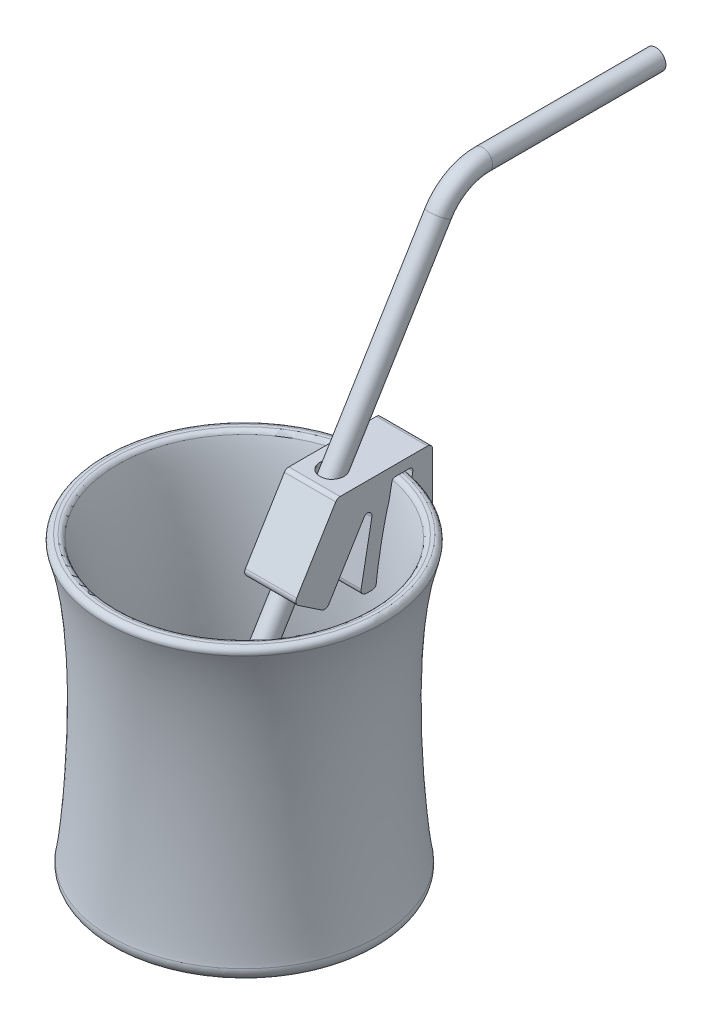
ISO-10303-21;
HEADER;
FILE_DESCRIPTION(('STEP AP214'),'2;1');
FILE_NAME('part.step','',(''),(''),'','','');
FILE_SCHEMA(('AUTOMOTIVE_DESIGN { 1 0 10303 214 1 1 1 1 }'));
ENDSEC;
DATA;
#1=APPLICATION_CONTEXT('core data for automotive mechanical design processes');
#2=APPLICATION_PROTOCOL_DEFINITION('international standard','automotive_design',2000,#1);
#3=PRODUCT_CONTEXT('',#1,'mechanical');
#4=PRODUCT('Part','Part','',(#3));
#5=PRODUCT_RELATED_PRODUCT_CATEGORY('part','',(#4));
#6=PRODUCT_DEFINITION_FORMATION('','',#4);
#7=PRODUCT_DEFINITION_CONTEXT('part definition',#1,'design');
#8=PRODUCT_DEFINITION('design','',#6,#7);
#9=PRODUCT_DEFINITION_SHAPE('','',#8);
#10=(LENGTH_UNIT() NAMED_UNIT(*) SI_UNIT(.MILLI.,.METRE.));
#11=(NAMED_UNIT(*) PLANE_ANGLE_UNIT() SI_UNIT($,.RADIAN.));
#12=(NAMED_UNIT(*) SI_UNIT($,.STERADIAN.) SOLID_ANGLE_UNIT());
#13=UNCERTAINTY_MEASURE_WITH_UNIT(LENGTH_MEASURE(1.E-05),#10,'distance_accuracy_value','');
#14=(GEOMETRIC_REPRESENTATION_CONTEXT(3) GLOBAL_UNCERTAINTY_ASSIGNED_CONTEXT((#13)) GLOBAL_UNIT_ASSIGNED_CONTEXT((#10,
#11,#12)) REPRESENTATION_CONTEXT('',''));
#15=CARTESIAN_POINT('',(0.,0.,0.));
#16=DIRECTION('',(0.,0.,1.));
#17=DIRECTION('',(1.,0.,0.));
#18=AXIS2_PLACEMENT_3D('',#15,#16,#17);
#19=CARTESIAN_POINT('',(0.,65.,0.));
#20=DIRECTION('',(0.,-1.,0.));
#21=DIRECTION('',(0.,0.,-1.));
#22=AXIS2_PLACEMENT_3D('',#19,#20,#21);
#23=PLANE('',#22);
#24=DIRECTION('',(0.,0.,-1.));
#25=VECTOR('',#24,1.);
#26=CARTESIAN_POINT('',(7.3977550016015,65.,-6.98460698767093));
#27=LINE('',#26,#25);
#28=CARTESIAN_POINT('',(7.3977550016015,65.,-27.8022079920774));
#29=VERTEX_POINT('',#28);
#30=CARTESIAN_POINT('',(7.3977550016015,65.,-29.4260350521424));
#31=VERTEX_POINT('',#30);
#32=EDGE_CURVE('E254',#29,#31,#27,.T.);
#33=ORIENTED_EDGE('',*,*,#32,.F.);
#34=DIRECTION('',(1.,0.,0.));
#35=VECTOR('',#34,1.);
#36=CARTESIAN_POINT('',(-7.39775500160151,65.,-27.8022079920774));
#37=LINE('',#36,#35);
#38=CARTESIAN_POINT('',(-7.3977550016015,65.,-27.8022079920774));
#39=VERTEX_POINT('',#38);
#40=EDGE_CURVE('E356',#29,#39,#37,.F.);
#41=ORIENTED_EDGE('',*,*,#40,.T.);
#42=DIRECTION('',(0.,0.,1.));
#43=VECTOR('',#42,1.);
#44=CARTESIAN_POINT('',(-7.3977550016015,65.,-6.98460698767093));
#45=LINE('',#44,#43);
#46=CARTESIAN_POINT('',(-7.3977550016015,65.,-29.4260350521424));
#47=VERTEX_POINT('',#46);
#48=EDGE_CURVE('E255',#47,#39,#45,.T.);
#49=ORIENTED_EDGE('',*,*,#48,.F.);
#50=DIRECTION('',(-1.,0.,0.));
#51=VECTOR('',#50,1.);
#52=CARTESIAN_POINT('',(7.3977550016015,65.,-29.4260350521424));
#53=LINE('',#52,#51);
#54=EDGE_CURVE('E358',#47,#31,#53,.F.);
#55=ORIENTED_EDGE('',*,*,#54,.T.);
#56=EDGE_LOOP('',(#33,#41,#49,#55));
#57=FACE_BOUND('',#56,.T.);
#58=ADVANCED_FACE('F49',(#57),#23,.T.);
#59=CARTESIAN_POINT('',(7.3977550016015,93.,-6.98460698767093));
#60=DIRECTION('',(-1.,0.,0.));
#61=DIRECTION('',(0.,0.,1.));
#62=AXIS2_PLACEMENT_3D('',#59,#60,#61);
#63=PLANE('',#62);
#64=DIRECTION('',(0.,-1.,0.));
#65=VECTOR('',#64,1.);
#66=CARTESIAN_POINT('',(7.3977550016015,93.,-46.9846069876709));
#67=LINE('',#66,#65);
#68=CARTESIAN_POINT('',(7.3977550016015,91.5,-46.9846069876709));
#69=VERTEX_POINT('',#68);
#70=CARTESIAN_POINT('',(7.3977550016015,66.5,-46.9846069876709));
#71=VERTEX_POINT('',#70);
#72=EDGE_CURVE('E268',#69,#71,#67,.T.);
#73=ORIENTED_EDGE('',*,*,#72,.F.);
#74=CARTESIAN_POINT('',(7.3977550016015,91.5,-45.4846069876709));
#75=DIRECTION('',(-1.,0.,0.));
#76=DIRECTION('',(0.,0.,1.));
#77=AXIS2_PLACEMENT_3D('',#74,#75,#76);
#78=CIRCLE('',#77,1.5);
#79=CARTESIAN_POINT('',(7.3977550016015,93.,-45.4846069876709));
#80=VERTEX_POINT('',#79);
#81=EDGE_CURVE('E377',#69,#80,#78,.F.);
#82=ORIENTED_EDGE('',*,*,#81,.T.);
#83=DIRECTION('',(0.,0.,-1.));
#84=VECTOR('',#83,1.);
#85=CARTESIAN_POINT('',(7.3977550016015,93.,-6.98460698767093));
#86=LINE('',#85,#84);
#87=CARTESIAN_POINT('',(7.3977550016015,93.,-20.2729170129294));
#88=VERTEX_POINT('',#87);
#89=EDGE_CURVE('E259',#88,#80,#86,.T.);
#90=ORIENTED_EDGE('',*,*,#89,.F.);
#91=CARTESIAN_POINT('',(7.3977550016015,91.5,-20.2729170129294));
#92=DIRECTION('',(-1.,0.,0.));
#93=DIRECTION('',(0.,0.,1.));
#94=AXIS2_PLACEMENT_3D('',#91,#92,#93);
#95=CIRCLE('',#94,1.5);
#96=CARTESIAN_POINT('',(7.3977550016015,92.2821554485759,-18.9929823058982));
#97=VERTEX_POINT('',#96);
#98=EDGE_CURVE('E379',#88,#97,#95,.F.);
#99=ORIENTED_EDGE('',*,*,#98,.T.);
#100=DIRECTION('',(0.,0.853289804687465,-0.521436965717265));
#101=VECTOR('',#100,1.);
#102=CARTESIAN_POINT('',(7.3977550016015,93.,-19.4316500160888));
#103=LINE('',#102,#101);
#104=CARTESIAN_POINT('',(7.3977550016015,73.8564616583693,-7.7332229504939));
#105=VERTEX_POINT('',#104);
#106=EDGE_CURVE('E288',#105,#97,#103,.T.);
#107=ORIENTED_EDGE('',*,*,#106,.F.);
#108=CARTESIAN_POINT('',(7.3977550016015,73.0743062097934,-9.0131576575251));
#109=DIRECTION('',(-1.,0.,0.));
#110=DIRECTION('',(0.,0.,1.));
#111=AXIS2_PLACEMENT_3D('',#108,#109,#110);
#112=CIRCLE('',#111,1.5);
#113=CARTESIAN_POINT('',(7.3977550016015,71.8298576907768,-8.1756925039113));
#114=VERTEX_POINT('',#113);
#115=EDGE_CURVE('E381',#105,#114,#112,.F.);
#116=ORIENTED_EDGE('',*,*,#115,.T.);
#117=DIRECTION('',(0.,0.558310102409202,0.829632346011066));
#118=VECTOR('',#117,1.);
#119=CARTESIAN_POINT('',(7.3977550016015,72.6314116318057,-6.98460698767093));
#120=LINE('',#119,#118);
#121=CARTESIAN_POINT('',(7.3977550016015,67.2939921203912,-14.9158549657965));
#122=VERTEX_POINT('',#121);
#123=EDGE_CURVE('E323',#122,#114,#120,.T.);
#124=ORIENTED_EDGE('',*,*,#123,.F.);
#125=CARTESIAN_POINT('',(7.3977550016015,68.5384406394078,-15.7533201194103));
#126=DIRECTION('',(-1.,0.,0.));
#127=DIRECTION('',(0.,0.,1.));
#128=AXIS2_PLACEMENT_3D('',#125,#126,#127);
#129=CIRCLE('',#128,1.5);
#130=CARTESIAN_POINT('',(7.3977550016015,67.7562851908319,-17.0332548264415));
#131=VERTEX_POINT('',#130);
#132=EDGE_CURVE('E383',#122,#131,#129,.F.);
#133=ORIENTED_EDGE('',*,*,#132,.T.);
#134=DIRECTION('',(0.,-0.853289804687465,0.521436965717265));
#135=VECTOR('',#134,1.);
#136=CARTESIAN_POINT('',(7.3977550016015,66.4190068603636,-16.2160572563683));
#137=LINE('',#136,#135);
#138=CARTESIAN_POINT('',(7.3977550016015,84.3241794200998,-27.1577312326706));
#139=VERTEX_POINT('',#138);
#140=EDGE_CURVE('E326',#139,#131,#137,.T.);
#141=ORIENTED_EDGE('',*,*,#140,.F.);
#142=CARTESIAN_POINT('',(7.3977550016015,83.5420239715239,-28.4376659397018));
#143=DIRECTION('',(-1.,0.,0.));
#144=DIRECTION('',(0.,0.,1.));
#145=AXIS2_PLACEMENT_3D('',#142,#143,#144);
#146=CIRCLE('',#145,1.5);
#147=CARTESIAN_POINT('',(7.3977550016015,85.0217132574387,-28.1916585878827));
#148=VERTEX_POINT('',#147);
#149=EDGE_CURVE('E71',#139,#148,#146,.T.);
#150=ORIENTED_EDGE('',*,*,#149,.T.);
#151=CARTESIAN_POINT('',(7.3977550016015,83.5420239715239,-27.9456512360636));
#152=DIRECTION('',(-1.,0.,0.));
#153=DIRECTION('',(0.,0.,1.));
#154=AXIS2_PLACEMENT_3D('',#151,#152,#153);
#155=CIRCLE('',#154,1.5);
#156=CARTESIAN_POINT('',(7.3977550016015,83.2655615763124,-29.4199539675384));
#157=VERTEX_POINT('',#156);
#158=EDGE_CURVE('E58',#148,#157,#155,.T.);
#159=ORIENTED_EDGE('',*,*,#158,.T.);
#160=DIRECTION('',(0.,0.982868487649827,-0.18430826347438));
#161=VECTOR('',#160,1.);
#162=CARTESIAN_POINT('',(7.3977550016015,85.0420239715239,-29.7530775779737));
#163=LINE('',#162,#161);
#164=CARTESIAN_POINT('',(7.3977550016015,66.7764623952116,-26.3279052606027));
#165=VERTEX_POINT('',#164);
#166=EDGE_CURVE('E329',#165,#157,#163,.T.);
#167=ORIENTED_EDGE('',*,*,#166,.F.);
#168=CARTESIAN_POINT('',(7.3977550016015,66.5,-27.8022079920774));
#169=DIRECTION('',(-1.,0.,0.));
#170=DIRECTION('',(0.,0.,1.));
#171=AXIS2_PLACEMENT_3D('',#168,#169,#170);
#172=CIRCLE('',#171,1.5);
#173=EDGE_CURVE('E385',#165,#29,#172,.F.);
#174=ORIENTED_EDGE('',*,*,#173,.T.);
#175=ORIENTED_EDGE('',*,*,#32,.T.);
#176=CARTESIAN_POINT('',(7.3977550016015,66.5,-29.4260350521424));
#177=DIRECTION('',(-1.,0.,0.));
#178=DIRECTION('',(0.,0.,1.));
#179=AXIS2_PLACEMENT_3D('',#176,#177,#178);
#180=CIRCLE('',#179,1.5);
#181=CARTESIAN_POINT('',(7.3977550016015,66.2235376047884,-30.9003377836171));
#182=VERTEX_POINT('',#181);
#183=EDGE_CURVE('E387',#31,#182,#180,.F.);
#184=ORIENTED_EDGE('',*,*,#183,.T.);
#185=DIRECTION('',(0.,-0.982868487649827,0.184308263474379));
#186=VECTOR('',#185,1.);
#187=CARTESIAN_POINT('',(7.3977550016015,89.1843082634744,-35.2059593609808));
#188=LINE('',#187,#186);
#189=CARTESIAN_POINT('',(7.3977550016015,89.1843082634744,-35.2059593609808));
#190=VERTEX_POINT('',#189);
#191=EDGE_CURVE('E225',#190,#182,#188,.T.);
#192=ORIENTED_EDGE('',*,*,#191,.F.);
#193=CARTESIAN_POINT('',(7.3977550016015,89.,-36.1888278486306));
#194=DIRECTION('',(1.,0.,0.));
#195=DIRECTION('',(0.,0.,-1.));
#196=AXIS2_PLACEMENT_3D('',#193,#194,#195);
#197=CIRCLE('',#196,1.);
#198=CARTESIAN_POINT('',(7.3977550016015,90.,-36.1888278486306));
#199=VERTEX_POINT('',#198);
#200=EDGE_CURVE('E233',#199,#190,#197,.T.);
#201=ORIENTED_EDGE('',*,*,#200,.F.);
#202=DIRECTION('',(0.,0.,1.));
#203=VECTOR('',#202,1.);
#204=CARTESIAN_POINT('',(7.3977550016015,90.,-40.2585483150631));
#205=LINE('',#204,#203);
#206=CARTESIAN_POINT('',(7.3977550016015,90.,-40.2585483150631));
#207=VERTEX_POINT('',#206);
#208=EDGE_CURVE('E231',#207,#199,#205,.T.);
#209=ORIENTED_EDGE('',*,*,#208,.F.);
#210=CARTESIAN_POINT('',(7.3977550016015,89.,-40.2585483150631));
#211=DIRECTION('',(1.,0.,0.));
#212=DIRECTION('',(0.,0.,-1.));
#213=AXIS2_PLACEMENT_3D('',#210,#211,#212);
#214=CIRCLE('',#213,1.);
#215=CARTESIAN_POINT('',(7.3977550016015,88.8156917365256,-41.2414168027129));
#216=VERTEX_POINT('',#215);
#217=EDGE_CURVE('E213',#216,#207,#214,.T.);
#218=ORIENTED_EDGE('',*,*,#217,.F.);
#219=DIRECTION('',(0.,0.982868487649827,-0.18430826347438));
#220=VECTOR('',#219,1.);
#221=CARTESIAN_POINT('',(7.3977550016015,65.,-36.7754797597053));
#222=LINE('',#221,#220);
#223=CARTESIAN_POINT('',(7.3977550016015,66.7764623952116,-37.1086033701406));
#224=VERTEX_POINT('',#223);
#225=EDGE_CURVE('E205',#224,#216,#222,.T.);
#226=ORIENTED_EDGE('',*,*,#225,.F.);
#227=CARTESIAN_POINT('',(7.3977550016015,66.5,-38.5829061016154));
#228=DIRECTION('',(-1.,0.,0.));
#229=DIRECTION('',(0.,0.,1.));
#230=AXIS2_PLACEMENT_3D('',#227,#228,#229);
#231=CIRCLE('',#230,1.5);
#232=CARTESIAN_POINT('',(7.3977550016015,65.,-38.5829061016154));
#233=VERTEX_POINT('',#232);
#234=EDGE_CURVE('E389',#224,#233,#231,.F.);
#235=ORIENTED_EDGE('',*,*,#234,.T.);
#236=CARTESIAN_POINT('',(7.3977550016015,65.,-45.4846069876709));
#237=VERTEX_POINT('',#236);
#238=EDGE_CURVE('E251',#233,#237,#27,.T.);
#239=ORIENTED_EDGE('',*,*,#238,.T.);
#240=CARTESIAN_POINT('',(7.3977550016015,66.5,-45.4846069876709));
#241=DIRECTION('',(-1.,0.,0.));
#242=DIRECTION('',(0.,0.,1.));
#243=AXIS2_PLACEMENT_3D('',#240,#241,#242);
#244=CIRCLE('',#243,1.5);
#245=EDGE_CURVE('E391',#237,#71,#244,.F.);
#246=ORIENTED_EDGE('',*,*,#245,.T.);
#247=EDGE_LOOP('',(#73,#82,#90,#99,#107,#116,#124,#133,#141,#150,#159,#167,#174,#175,#184,#192,
#201,#209,#218,#226,#235,#239,#246));
#248=FACE_BOUND('',#247,.T.);
#249=ADVANCED_FACE('F228',(#248),#63,.F.);
#250=CARTESIAN_POINT('',(-7.3977550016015,93.,-46.9846069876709));
#251=DIRECTION('',(0.,0.,1.));
#252=DIRECTION('',(1.,0.,0.));
#253=AXIS2_PLACEMENT_3D('',#250,#251,#252);
#254=PLANE('',#253);
#255=DIRECTION('',(0.,-1.,0.));
#256=VECTOR('',#255,1.);
#257=CARTESIAN_POINT('',(-7.3977550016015,93.,-46.9846069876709));
#258=LINE('',#257,#256);
#259=CARTESIAN_POINT('',(-7.3977550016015,91.5,-46.9846069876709));
#260=VERTEX_POINT('',#259);
#261=CARTESIAN_POINT('',(-7.3977550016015,66.5,-46.9846069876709));
#262=VERTEX_POINT('',#261);
#263=EDGE_CURVE('E265',#260,#262,#258,.T.);
#264=ORIENTED_EDGE('',*,*,#263,.F.);
#265=DIRECTION('',(-1.,0.,0.));
#266=VECTOR('',#265,1.);
#267=CARTESIAN_POINT('',(-7.3977550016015,91.5,-46.9846069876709));
#268=LINE('',#267,#266);
#269=EDGE_CURVE('E393',#260,#69,#268,.F.);
#270=ORIENTED_EDGE('',*,*,#269,.T.);
#271=ORIENTED_EDGE('',*,*,#72,.T.);
#272=DIRECTION('',(-1.,0.,0.));
#273=VECTOR('',#272,1.);
#274=CARTESIAN_POINT('',(-7.3977550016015,66.5,-46.9846069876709));
#275=LINE('',#274,#273);
#276=EDGE_CURVE('E395',#71,#262,#275,.T.);
#277=ORIENTED_EDGE('',*,*,#276,.T.);
#278=EDGE_LOOP('',(#264,#270,#271,#277));
#279=FACE_BOUND('',#278,.T.);
#280=ADVANCED_FACE('F465',(#279),#254,.F.);
#281=CARTESIAN_POINT('',(-7.3977550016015,93.,-6.98460698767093));
#282=DIRECTION('',(1.,0.,0.));
#283=DIRECTION('',(0.,0.,-1.));
#284=AXIS2_PLACEMENT_3D('',#281,#282,#283);
#285=PLANE('',#284);
#286=DIRECTION('',(0.,0.,1.));
#287=VECTOR('',#286,1.);
#288=CARTESIAN_POINT('',(-7.3977550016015,93.,-6.98460698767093));
#289=LINE('',#288,#287);
#290=CARTESIAN_POINT('',(-7.3977550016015,93.,-45.4846069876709));
#291=VERTEX_POINT('',#290);
#292=CARTESIAN_POINT('',(-7.3977550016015,93.,-20.2729170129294));
#293=VERTEX_POINT('',#292);
#294=EDGE_CURVE('E262',#291,#293,#289,.T.);
#295=ORIENTED_EDGE('',*,*,#294,.F.);
#296=CARTESIAN_POINT('',(-7.3977550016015,91.5,-45.4846069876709));
#297=DIRECTION('',(1.,0.,0.));
#298=DIRECTION('',(0.,0.,-1.));
#299=AXIS2_PLACEMENT_3D('',#296,#297,#298);
#300=CIRCLE('',#299,1.5);
#301=EDGE_CURVE('E398',#291,#260,#300,.F.);
#302=ORIENTED_EDGE('',*,*,#301,.T.);
#303=ORIENTED_EDGE('',*,*,#263,.T.);
#304=CARTESIAN_POINT('',(-7.3977550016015,66.5,-45.4846069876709));
#305=DIRECTION('',(1.,0.,0.));
#306=DIRECTION('',(0.,0.,-1.));
#307=AXIS2_PLACEMENT_3D('',#304,#305,#306);
#308=CIRCLE('',#307,1.5);
#309=CARTESIAN_POINT('',(-7.3977550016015,65.,-45.4846069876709));
#310=VERTEX_POINT('',#309);
#311=EDGE_CURVE('E412',#262,#310,#308,.F.);
#312=ORIENTED_EDGE('',*,*,#311,.T.);
#313=CARTESIAN_POINT('',(-7.3977550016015,65.,-38.5829061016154));
#314=VERTEX_POINT('',#313);
#315=EDGE_CURVE('E258',#310,#314,#45,.T.);
#316=ORIENTED_EDGE('',*,*,#315,.T.);
#317=CARTESIAN_POINT('',(-7.3977550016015,66.5,-38.5829061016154));
#318=DIRECTION('',(1.,0.,0.));
#319=DIRECTION('',(0.,0.,-1.));
#320=AXIS2_PLACEMENT_3D('',#317,#318,#319);
#321=CIRCLE('',#320,1.5);
#322=CARTESIAN_POINT('',(-7.3977550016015,66.7764623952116,-37.1086033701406));
#323=VERTEX_POINT('',#322);
#324=EDGE_CURVE('E410',#314,#323,#321,.F.);
#325=ORIENTED_EDGE('',*,*,#324,.T.);
#326=DIRECTION('',(0.,0.982868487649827,-0.18430826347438));
#327=VECTOR('',#326,1.);
#328=CARTESIAN_POINT('',(-7.3977550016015,86.6522130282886,-40.8357195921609));
#329=LINE('',#328,#327);
#330=CARTESIAN_POINT('',(-7.3977550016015,88.8156917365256,-41.2414168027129));
#331=VERTEX_POINT('',#330);
#332=EDGE_CURVE('E243',#323,#331,#329,.T.);
#333=ORIENTED_EDGE('',*,*,#332,.T.);
#334=CARTESIAN_POINT('',(-7.3977550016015,89.,-40.2585483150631));
#335=DIRECTION('',(1.,0.,0.));
#336=DIRECTION('',(0.,0.,-1.));
#337=AXIS2_PLACEMENT_3D('',#334,#335,#336);
#338=CIRCLE('',#337,1.);
#339=CARTESIAN_POINT('',(-7.3977550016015,90.,-40.2585483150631));
#340=VERTEX_POINT('',#339);
#341=EDGE_CURVE('E223',#331,#340,#338,.T.);
#342=ORIENTED_EDGE('',*,*,#341,.T.);
#343=DIRECTION('',(0.,0.,1.));
#344=VECTOR('',#343,1.);
#345=CARTESIAN_POINT('',(-7.3977550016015,90.,-6.98460698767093));
#346=LINE('',#345,#344);
#347=CARTESIAN_POINT('',(-7.3977550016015,90.,-36.1888278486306));
#348=VERTEX_POINT('',#347);
#349=EDGE_CURVE('E273',#340,#348,#346,.T.);
#350=ORIENTED_EDGE('',*,*,#349,.T.);
#351=CARTESIAN_POINT('',(-7.3977550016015,89.,-36.1888278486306));
#352=DIRECTION('',(1.,0.,0.));
#353=DIRECTION('',(0.,0.,-1.));
#354=AXIS2_PLACEMENT_3D('',#351,#352,#353);
#355=CIRCLE('',#354,1.);
#356=CARTESIAN_POINT('',(-7.3977550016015,89.1843082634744,-35.2059593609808));
#357=VERTEX_POINT('',#356);
#358=EDGE_CURVE('E276',#348,#357,#355,.T.);
#359=ORIENTED_EDGE('',*,*,#358,.T.);
#360=DIRECTION('',(0.,-0.982868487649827,0.184308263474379));
#361=VECTOR('',#360,1.);
#362=CARTESIAN_POINT('',(-7.3977550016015,87.7580626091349,-34.938508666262));
#363=LINE('',#362,#361);
#364=CARTESIAN_POINT('',(-7.3977550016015,66.2235376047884,-30.9003377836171));
#365=VERTEX_POINT('',#364);
#366=EDGE_CURVE('E248',#357,#365,#363,.T.);
#367=ORIENTED_EDGE('',*,*,#366,.T.);
#368=CARTESIAN_POINT('',(-7.3977550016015,66.5,-29.4260350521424));
#369=DIRECTION('',(1.,0.,0.));
#370=DIRECTION('',(0.,0.,-1.));
#371=AXIS2_PLACEMENT_3D('',#368,#369,#370);
#372=CIRCLE('',#371,1.5);
#373=EDGE_CURVE('E408',#365,#47,#372,.F.);
#374=ORIENTED_EDGE('',*,*,#373,.T.);
#375=ORIENTED_EDGE('',*,*,#48,.T.);
#376=CARTESIAN_POINT('',(-7.3977550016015,66.5,-27.8022079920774));
#377=DIRECTION('',(1.,0.,0.));
#378=DIRECTION('',(0.,0.,-1.));
#379=AXIS2_PLACEMENT_3D('',#376,#377,#378);
#380=CIRCLE('',#379,1.5);
#381=CARTESIAN_POINT('',(-7.3977550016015,66.7764623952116,-26.3279052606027));
#382=VERTEX_POINT('',#381);
#383=EDGE_CURVE('E406',#39,#382,#380,.F.);
#384=ORIENTED_EDGE('',*,*,#383,.T.);
#385=DIRECTION('',(0.,0.982868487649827,-0.18430826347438));
#386=VECTOR('',#385,1.);
#387=CARTESIAN_POINT('',(-7.3977550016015,88.6051449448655,-30.4212367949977));
#388=LINE('',#387,#386);
#389=CARTESIAN_POINT('',(-7.3977550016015,83.2655615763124,-29.4199539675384));
#390=VERTEX_POINT('',#389);
#391=EDGE_CURVE('E279',#382,#390,#388,.T.);
#392=ORIENTED_EDGE('',*,*,#391,.T.);
#393=CARTESIAN_POINT('',(-7.3977550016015,83.5420239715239,-27.9456512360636));
#394=DIRECTION('',(1.,0.,0.));
#395=DIRECTION('',(0.,0.,-1.));
#396=AXIS2_PLACEMENT_3D('',#393,#394,#395);
#397=CIRCLE('',#396,1.5);
#398=CARTESIAN_POINT('',(-7.3977550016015,85.0217132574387,-28.1916585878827));
#399=VERTEX_POINT('',#398);
#400=EDGE_CURVE('E12',#390,#399,#397,.T.);
#401=ORIENTED_EDGE('',*,*,#400,.T.);
#402=CARTESIAN_POINT('',(-7.3977550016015,83.5420239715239,-28.4376659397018));
#403=DIRECTION('',(1.,0.,0.));
#404=DIRECTION('',(0.,0.,-1.));
#405=AXIS2_PLACEMENT_3D('',#402,#403,#404);
#406=CIRCLE('',#405,1.5);
#407=CARTESIAN_POINT('',(-7.3977550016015,84.3241794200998,-27.1577312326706));
#408=VERTEX_POINT('',#407);
#409=EDGE_CURVE('E340',#399,#408,#406,.T.);
#410=ORIENTED_EDGE('',*,*,#409,.T.);
#411=DIRECTION('',(0.,-0.853289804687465,0.521436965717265));
#412=VECTOR('',#411,1.);
#413=CARTESIAN_POINT('',(-7.3977550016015,81.6653083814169,-25.5329214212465));
#414=LINE('',#413,#412);
#415=CARTESIAN_POINT('',(-7.3977550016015,67.7562851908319,-17.0332548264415));
#416=VERTEX_POINT('',#415);
#417=EDGE_CURVE('E419',#408,#416,#414,.T.);
#418=ORIENTED_EDGE('',*,*,#417,.T.);
#419=CARTESIAN_POINT('',(-7.3977550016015,68.5384406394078,-15.7533201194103));
#420=DIRECTION('',(1.,0.,0.));
#421=DIRECTION('',(0.,0.,-1.));
#422=AXIS2_PLACEMENT_3D('',#419,#420,#421);
#423=CIRCLE('',#422,1.5);
#424=CARTESIAN_POINT('',(-7.3977550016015,67.2939921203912,-14.9158549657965));
#425=VERTEX_POINT('',#424);
#426=EDGE_CURVE('E404',#416,#425,#423,.F.);
#427=ORIENTED_EDGE('',*,*,#426,.T.);
#428=DIRECTION('',(0.,0.558310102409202,0.829632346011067));
#429=VECTOR('',#428,1.);
#430=CARTESIAN_POINT('',(-7.3977550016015,78.9805077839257,2.4499626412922));
#431=LINE('',#430,#429);
#432=CARTESIAN_POINT('',(-7.3977550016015,71.8298576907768,-8.1756925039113));
#433=VERTEX_POINT('',#432);
#434=EDGE_CURVE('E287',#425,#433,#431,.T.);
#435=ORIENTED_EDGE('',*,*,#434,.T.);
#436=CARTESIAN_POINT('',(-7.3977550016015,73.0743062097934,-9.0131576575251));
#437=DIRECTION('',(1.,0.,0.));
#438=DIRECTION('',(0.,0.,-1.));
#439=AXIS2_PLACEMENT_3D('',#436,#437,#438);
#440=CIRCLE('',#439,1.5);
#441=CARTESIAN_POINT('',(-7.3977550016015,73.8564616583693,-7.7332229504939));
#442=VERTEX_POINT('',#441);
#443=EDGE_CURVE('E402',#433,#442,#440,.F.);
#444=ORIENTED_EDGE('',*,*,#443,.T.);
#445=DIRECTION('',(0.,0.853289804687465,-0.521436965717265));
#446=VECTOR('',#445,1.);
#447=CARTESIAN_POINT('',(-7.3977550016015,87.4618519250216,-16.0473424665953));
#448=LINE('',#447,#446);
#449=CARTESIAN_POINT('',(-7.3977550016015,92.2821554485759,-18.9929823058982));
#450=VERTEX_POINT('',#449);
#451=EDGE_CURVE('E316',#442,#450,#448,.T.);
#452=ORIENTED_EDGE('',*,*,#451,.T.);
#453=CARTESIAN_POINT('',(-7.3977550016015,91.5,-20.2729170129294));
#454=DIRECTION('',(1.,0.,0.));
#455=DIRECTION('',(0.,0.,-1.));
#456=AXIS2_PLACEMENT_3D('',#453,#454,#455);
#457=CIRCLE('',#456,1.5);
#458=EDGE_CURVE('E400',#450,#293,#457,.F.);
#459=ORIENTED_EDGE('',*,*,#458,.T.);
#460=EDGE_LOOP('',(#295,#302,#303,#312,#316,#325,#333,#342,#350,#359,#367,#374,#375,#384,#392,
#401,#410,#418,#427,#435,#444,#452,#459));
#461=FACE_BOUND('',#460,.T.);
#462=ADVANCED_FACE('F425',(#461),#285,.F.);
#463=CARTESIAN_POINT('',(0.,93.,0.));
#464=DIRECTION('',(0.,-1.,0.));
#465=DIRECTION('',(0.,0.,-1.));
#466=AXIS2_PLACEMENT_3D('',#463,#464,#465);
#467=PLANE('',#466);
#468=CARTESIAN_POINT('',(-0.559370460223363,93.,-22.3820204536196));
#469=CARTESIAN_POINT('',(-0.362773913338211,93.,-22.3820291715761));
#470=CARTESIAN_POINT('',(-0.166034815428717,93.,-22.3986404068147));
#471=CARTESIAN_POINT('',(0.222025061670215,93.,-22.4646754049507));
#472=CARTESIAN_POINT('',(0.413339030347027,93.,-22.5141386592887));
#473=CARTESIAN_POINT('',(0.784870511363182,93.,-22.6444695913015));
#474=CARTESIAN_POINT('',(0.965093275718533,93.,-22.7253222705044));
#475=CARTESIAN_POINT('',(1.30935620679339,93.,-22.916116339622));
#476=CARTESIAN_POINT('',(1.4734003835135,93.,-23.0260504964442));
#477=CARTESIAN_POINT('',(1.7807244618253,93.,-23.2719090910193));
#478=CARTESIAN_POINT('',(1.9240021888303,93.,-23.4078362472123));
#479=CARTESIAN_POINT('',(2.18570906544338,93.,-23.7018209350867));
#480=CARTESIAN_POINT('',(2.30413723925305,93.,-23.8598793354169));
#481=CARTESIAN_POINT('',(2.51277450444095,93.,-24.1936323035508));
#482=CARTESIAN_POINT('',(2.60298412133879,93.,-24.3693265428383));
#483=CARTESIAN_POINT('',(2.75262620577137,93.,-24.733365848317));
#484=CARTESIAN_POINT('',(2.81205873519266,93.,-24.921710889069));
#485=CARTESIAN_POINT('',(2.89845992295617,93.,-25.3057059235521));
#486=CARTESIAN_POINT('',(2.92542851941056,93.,-25.5013559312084));
#487=CARTESIAN_POINT('',(2.94613604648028,93.,-25.8944062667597));
#488=CARTESIAN_POINT('',(2.93987503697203,93.,-26.0918065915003));
#489=CARTESIAN_POINT('',(2.89430121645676,93.,-26.4827543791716));
#490=CARTESIAN_POINT('',(2.85498839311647,93.,-26.6763018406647));
#491=CARTESIAN_POINT('',(2.74442684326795,93.,-27.054049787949));
#492=CARTESIAN_POINT('',(2.67317808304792,93.,-27.2382502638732));
#493=CARTESIAN_POINT('',(2.50076722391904,93.,-27.5920750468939));
#494=CARTESIAN_POINT('',(2.39960513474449,93.,-27.7616993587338));
#495=CARTESIAN_POINT('',(2.17023935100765,93.,-28.08155667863));
#496=CARTESIAN_POINT('',(2.04203566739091,93.,-28.2317896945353));
#497=CARTESIAN_POINT('',(1.76222597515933,93.,-28.5085998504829));
#498=CARTESIAN_POINT('',(1.61061996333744,93.,-28.6351769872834));
#499=CARTESIAN_POINT('',(1.28830925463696,93.,-28.8610822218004));
#500=CARTESIAN_POINT('',(1.1176045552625,93.,-28.9604103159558));
#501=CARTESIAN_POINT('',(0.761942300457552,93.,-29.1289978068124));
#502=CARTESIAN_POINT('',(0.576984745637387,93.,-29.1982572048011));
#503=CARTESIAN_POINT('',(0.198067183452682,93.,-29.3047412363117));
#504=CARTESIAN_POINT('',(0.00410717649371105,93.,-29.341965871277));
#505=CARTESIAN_POINT('',(-0.387309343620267,93.,-29.3833236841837));
#506=CARTESIAN_POINT('',(-0.584765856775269,93.,-29.3874568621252));
#507=CARTESIAN_POINT('',(-0.97757018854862,93.,-29.3625144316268));
#508=CARTESIAN_POINT('',(-1.17291800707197,93.,-29.3334388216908));
#509=CARTESIAN_POINT('',(-1.55595959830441,93.,-29.2429041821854));
#510=CARTESIAN_POINT('',(-1.74365337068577,93.,-29.1814451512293));
#511=CARTESIAN_POINT('',(-2.10605876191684,93.,-29.0278883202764));
#512=CARTESIAN_POINT('',(-2.28077038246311,93.,-28.9357905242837));
#513=CARTESIAN_POINT('',(-2.61225192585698,93.,-28.7235705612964));
#514=CARTESIAN_POINT('',(-2.76902185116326,93.,-28.6034483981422));
#515=CARTESIAN_POINT('',(-3.06016985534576,93.,-28.3385895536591));
#516=CARTESIAN_POINT('',(-3.19454792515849,93.,-28.1938528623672));
#517=CARTESIAN_POINT('',(-3.43709758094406,93.,-27.883873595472));
#518=CARTESIAN_POINT('',(-3.54526915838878,93.,-27.7186310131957));
#519=CARTESIAN_POINT('',(-3.73233499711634,93.,-27.3723309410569));
#520=CARTESIAN_POINT('',(-3.81122928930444,92.9999999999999,-27.191273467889));
#521=CARTESIAN_POINT('',(-3.93750112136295,92.9999999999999,-26.818483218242));
#522=CARTESIAN_POINT('',(-3.98487867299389,93.,-26.6267504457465));
#523=CARTESIAN_POINT('',(-4.04677221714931,93.,-26.2380519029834));
#524=CARTESIAN_POINT('',(-4.0612881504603,93.,-26.041086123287));
#525=CARTESIAN_POINT('',(-4.05704623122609,93.,-25.6475135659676));
#526=CARTESIAN_POINT('',(-4.03828844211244,93.,-25.4509067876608));
#527=CARTESIAN_POINT('',(-3.96803157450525,93.,-25.0636325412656));
#528=CARTESIAN_POINT('',(-3.91653243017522,93.,-24.8729650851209));
#529=CARTESIAN_POINT('',(-3.78225357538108,93.,-24.5029789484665));
#530=CARTESIAN_POINT('',(-3.69947328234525,93.,-24.3236604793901));
#531=CARTESIAN_POINT('',(-3.50498552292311,93.,-23.9814733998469));
#532=CARTESIAN_POINT('',(-3.39327919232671,93.,-23.8186041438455));
#533=CARTESIAN_POINT('',(-3.14412366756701,93.,-23.5139468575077));
#534=CARTESIAN_POINT('',(-3.00667716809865,93.,-23.3721566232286));
#535=CARTESIAN_POINT('',(-2.70989052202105,93.,-23.1136280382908));
#536=CARTESIAN_POINT('',(-2.55054494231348,93.,-22.996895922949));
#537=CARTESIAN_POINT('',(-2.21445567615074,93.,-22.7917964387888));
#538=CARTESIAN_POINT('',(-2.03770371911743,93.,-22.7034426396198));
#539=CARTESIAN_POINT('',(-1.67201380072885,93.,-22.5577650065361));
#540=CARTESIAN_POINT('',(-1.48309075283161,92.9999999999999,-22.5004039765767));
#541=CARTESIAN_POINT('',(-1.17069815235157,93.,-22.4336281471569));
#542=CARTESIAN_POINT('',(-1.04925845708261,93.,-22.4142994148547));
#543=CARTESIAN_POINT('',(-0.805021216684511,93.,-22.3884928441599));
#544=CARTESIAN_POINT('',(-0.682223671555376,93.,-22.3820150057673));
#545=CARTESIAN_POINT('',(-0.559370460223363,93.,-22.3820204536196));
#546=B_SPLINE_CURVE_WITH_KNOTS('',3,(#468,#469,#470,#471,#472,#473,#474,#475,#476,#477,#478,
#479,#480,#481,#482,#483,#484,#485,#486,#487,#488,#489,#490,#491,#492,#493,#494,#495,#496,#497,
#498,#499,#500,#501,#502,#503,#504,#505,#506,#507,#508,#509,#510,#511,#512,#513,#514,#515,#516,
#517,#518,#519,#520,#521,#522,#523,#524,#525,#526,#527,#528,#529,#530,#531,#532,#533,#534,#535,
#536,#537,#538,#539,#540,#541,#542,#543,#544,#545),.UNSPECIFIED.,.T.,.F.,(4,2,2,2,2,2,2,2,2,2,2,
2,2,2,2,2,2,2,2,2,2,2,2,2,2,2,2,2,2,2,2,2,2,2,2,2,2,2,4),(0.,0.589341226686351,1.17939218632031,
1.76916155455,2.35878437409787,2.94846889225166,3.53817656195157,4.12787324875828,
4.7175687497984,5.30726537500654,5.89696093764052,6.48665672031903,7.07635312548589,
7.66604933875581,8.25574531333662,8.84544136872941,9.43513750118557,10.0248336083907,
10.6145296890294,11.2042257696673,11.7939218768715,12.383618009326,12.9733140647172,
13.5630100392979,14.1527062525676,14.7424026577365,15.3320984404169,15.9217940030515,
16.5114906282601,17.1011861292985,17.6908828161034,18.2805904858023,18.8702750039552,
19.4598978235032,20.0496671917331,20.6397181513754,21.22905937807,21.5973387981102,
21.9656182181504),.UNSPECIFIED.);
#547=CARTESIAN_POINT('',(-0.559370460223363,93.,-22.3820204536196));
#548=VERTEX_POINT('',#547);
#549=EDGE_CURVE('E214',#548,#548,#546,.T.);
#550=ORIENTED_EDGE('',*,*,#549,.F.);
#551=EDGE_LOOP('',(#550));
#552=FACE_BOUND('',#551,.T.);
#553=ORIENTED_EDGE('',*,*,#89,.T.);
#554=DIRECTION('',(-1.,0.,0.));
#555=VECTOR('',#554,1.);
#556=CARTESIAN_POINT('',(0.,93.,-45.4846069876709));
#557=LINE('',#556,#555);
#558=EDGE_CURVE('E414',#80,#291,#557,.T.);
#559=ORIENTED_EDGE('',*,*,#558,.T.);
#560=ORIENTED_EDGE('',*,*,#294,.T.);
#561=DIRECTION('',(1.,0.,0.));
#562=VECTOR('',#561,1.);
#563=CARTESIAN_POINT('',(0.,93.,-20.2729170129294));
#564=LINE('',#563,#562);
#565=EDGE_CURVE('E417',#293,#88,#564,.T.);
#566=ORIENTED_EDGE('',*,*,#565,.T.);
#567=EDGE_LOOP('',(#553,#559,#560,#566));
#568=FACE_BOUND('',#567,.T.);
#569=ADVANCED_FACE('F471',(#552,#568),#467,.F.);
#570=ORIENTED_EDGE('',*,*,#238,.F.);
#571=DIRECTION('',(1.,0.,0.));
#572=VECTOR('',#571,1.);
#573=CARTESIAN_POINT('',(-7.3977550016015,65.,-38.5829061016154));
#574=LINE('',#573,#572);
#575=EDGE_CURVE('E348',#233,#314,#574,.F.);
#576=ORIENTED_EDGE('',*,*,#575,.T.);
#577=ORIENTED_EDGE('',*,*,#315,.F.);
#578=DIRECTION('',(-1.,0.,0.));
#579=VECTOR('',#578,1.);
#580=CARTESIAN_POINT('',(7.3977550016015,65.,-45.4846069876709));
#581=LINE('',#580,#579);
#582=EDGE_CURVE('E350',#310,#237,#581,.F.);
#583=ORIENTED_EDGE('',*,*,#582,.T.);
#584=EDGE_LOOP('',(#570,#576,#577,#583));
#585=FACE_BOUND('',#584,.T.);
#586=ADVANCED_FACE('F457',(#585),#23,.T.);
#587=CARTESIAN_POINT('',(-17.6022449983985,89.,-36.1888278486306));
#588=DIRECTION('',(1.,0.,0.));
#589=DIRECTION('',(0.,0.,-1.));
#590=AXIS2_PLACEMENT_3D('',#587,#588,#589);
#591=CYLINDRICAL_SURFACE('',#590,1.);
#592=DIRECTION('',(1.,0.,0.));
#593=VECTOR('',#592,1.);
#594=CARTESIAN_POINT('',(-17.6022449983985,90.,-36.1888278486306));
#595=LINE('',#594,#593);
#596=EDGE_CURVE('E244',#348,#199,#595,.T.);
#597=ORIENTED_EDGE('',*,*,#596,.T.);
#598=ORIENTED_EDGE('',*,*,#200,.T.);
#599=DIRECTION('',(1.,0.,0.));
#600=VECTOR('',#599,1.);
#601=CARTESIAN_POINT('',(-17.6022449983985,89.1843082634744,-35.2059593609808));
#602=LINE('',#601,#600);
#603=EDGE_CURVE('E241',#357,#190,#602,.T.);
#604=ORIENTED_EDGE('',*,*,#603,.F.);
#605=ORIENTED_EDGE('',*,*,#358,.F.);
#606=EDGE_LOOP('',(#597,#598,#604,#605));
#607=FACE_BOUND('',#606,.T.);
#608=ADVANCED_FACE('F445',(#607),#591,.F.);
#609=CARTESIAN_POINT('',(-17.6022449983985,90.,-40.2585483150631));
#610=DIRECTION('',(0.,1.,0.));
#611=DIRECTION('',(0.,0.,1.));
#612=AXIS2_PLACEMENT_3D('',#609,#610,#611);
#613=PLANE('',#612);
#614=DIRECTION('',(1.,0.,0.));
#615=VECTOR('',#614,1.);
#616=CARTESIAN_POINT('',(-17.6022449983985,90.,-40.2585483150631));
#617=LINE('',#616,#615);
#618=EDGE_CURVE('E224',#340,#207,#617,.T.);
#619=ORIENTED_EDGE('',*,*,#618,.T.);
#620=ORIENTED_EDGE('',*,*,#208,.T.);
#621=ORIENTED_EDGE('',*,*,#596,.F.);
#622=ORIENTED_EDGE('',*,*,#349,.F.);
#623=EDGE_LOOP('',(#619,#620,#621,#622));
#624=FACE_BOUND('',#623,.T.);
#625=ADVANCED_FACE('F448',(#624),#613,.F.);
#626=CARTESIAN_POINT('',(-17.6022449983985,89.,-40.2585483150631));
#627=DIRECTION('',(1.,0.,0.));
#628=DIRECTION('',(0.,0.,-1.));
#629=AXIS2_PLACEMENT_3D('',#626,#627,#628);
#630=CYLINDRICAL_SURFACE('',#629,1.);
#631=DIRECTION('',(1.,0.,0.));
#632=VECTOR('',#631,1.);
#633=CARTESIAN_POINT('',(-17.6022449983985,88.8156917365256,-41.2414168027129));
#634=LINE('',#633,#632);
#635=EDGE_CURVE('E209',#331,#216,#634,.T.);
#636=ORIENTED_EDGE('',*,*,#635,.T.);
#637=ORIENTED_EDGE('',*,*,#217,.T.);
#638=ORIENTED_EDGE('',*,*,#618,.F.);
#639=ORIENTED_EDGE('',*,*,#341,.F.);
#640=EDGE_LOOP('',(#636,#637,#638,#639));
#641=FACE_BOUND('',#640,.T.);
#642=ADVANCED_FACE('F219',(#641),#630,.F.);
#643=CARTESIAN_POINT('',(-17.6022449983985,89.1843082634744,-35.2059593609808));
#644=DIRECTION('',(0.,0.184308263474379,0.982868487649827));
#645=DIRECTION('',(0.,-0.982868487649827,0.184308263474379));
#646=AXIS2_PLACEMENT_3D('',#643,#644,#645);
#647=PLANE('',#646);
#648=ORIENTED_EDGE('',*,*,#191,.T.);
#649=DIRECTION('',(-1.,0.,0.));
#650=VECTOR('',#649,1.);
#651=CARTESIAN_POINT('',(-7.3977550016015,66.2235376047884,-30.9003377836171));
#652=LINE('',#651,#650);
#653=EDGE_CURVE('E353',#182,#365,#652,.T.);
#654=ORIENTED_EDGE('',*,*,#653,.T.);
#655=ORIENTED_EDGE('',*,*,#366,.F.);
#656=ORIENTED_EDGE('',*,*,#603,.T.);
#657=EDGE_LOOP('',(#648,#654,#655,#656));
#658=FACE_BOUND('',#657,.T.);
#659=ADVANCED_FACE('F442',(#658),#647,.F.);
#660=CARTESIAN_POINT('',(-17.6022449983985,65.,-36.7754797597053));
#661=DIRECTION('',(0.,-0.18430826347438,-0.982868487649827));
#662=DIRECTION('',(0.,0.982868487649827,-0.18430826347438));
#663=AXIS2_PLACEMENT_3D('',#660,#661,#662);
#664=PLANE('',#663);
#665=ORIENTED_EDGE('',*,*,#332,.F.);
#666=DIRECTION('',(1.,0.,0.));
#667=VECTOR('',#666,1.);
#668=CARTESIAN_POINT('',(7.3977550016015,66.7764623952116,-37.1086033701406));
#669=LINE('',#668,#667);
#670=EDGE_CURVE('E211',#323,#224,#669,.T.);
#671=ORIENTED_EDGE('',*,*,#670,.T.);
#672=ORIENTED_EDGE('',*,*,#225,.T.);
#673=ORIENTED_EDGE('',*,*,#635,.F.);
#674=EDGE_LOOP('',(#665,#671,#672,#673));
#675=FACE_BOUND('',#674,.T.);
#676=ADVANCED_FACE('F208',(#675),#664,.F.);
#677=CARTESIAN_POINT('',(-0.559370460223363,63.9738162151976,-4.64440643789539));
#678=CARTESIAN_POINT('',(-0.559370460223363,94.0261837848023,-23.0091112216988));
#679=CARTESIAN_POINT('',(6.44062953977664,63.9738162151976,-4.64440643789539));
#680=CARTESIAN_POINT('',(6.44062953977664,94.0261837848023,-23.0091112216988));
#681=CARTESIAN_POINT('',(6.44062953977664,63.9738162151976,-11.6444064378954));
#682=CARTESIAN_POINT('',(6.44062953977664,94.0261837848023,-30.0091112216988));
#683=CARTESIAN_POINT('',(-0.559370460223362,63.9738162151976,-11.6444064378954));
#684=CARTESIAN_POINT('',(-0.559370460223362,94.0261837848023,-30.0091112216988));
#685=CARTESIAN_POINT('',(-7.55937046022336,63.9738162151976,-11.6444064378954));
#686=CARTESIAN_POINT('',(-7.55937046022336,94.0261837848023,-30.0091112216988));
#687=CARTESIAN_POINT('',(-7.55937046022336,63.9738162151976,-4.64440643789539));
#688=CARTESIAN_POINT('',(-7.55937046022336,94.0261837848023,-23.0091112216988));
#689=CARTESIAN_POINT('',(-0.559370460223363,63.9738162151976,-4.64440643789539));
#690=CARTESIAN_POINT('',(-0.559370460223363,94.0261837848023,-23.0091112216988));
#691=(BOUNDED_SURFACE() B_SPLINE_SURFACE(3,1,((#677,#678),(#679,#680),(#681,#682),(#683,#684),
(#685,#686),(#687,#688),(#689,#690)),.UNSPECIFIED.,.T.,.F.,.F.) B_SPLINE_SURFACE_WITH_KNOTS((4,
3,4),(2,2),(0.,0.5,1.),(0.,1.),
.UNSPECIFIED.) GEOMETRIC_REPRESENTATION_ITEM() RATIONAL_B_SPLINE_SURFACE(((1.,1.),
(0.333333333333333,0.333333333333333),(0.333333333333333,0.333333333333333),(1.,1.),
(0.333333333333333,0.333333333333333),(0.333333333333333,0.333333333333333),(1.,1.))) REPRESENTATION_ITEM('') SURFACE());
#692=CARTESIAN_POINT('',(-0.559370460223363,71.2245040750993,-9.0752301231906));
#693=CARTESIAN_POINT('',(-0.790626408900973,71.2245017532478,-9.07523357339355));
#694=CARTESIAN_POINT('',(-1.02199058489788,71.2135720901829,-9.09147473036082));
#695=CARTESIAN_POINT('',(-1.4688097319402,71.170689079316,-9.15519761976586));
#696=CARTESIAN_POINT('',(-1.68453056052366,71.1395968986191,-9.2013996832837));
#697=CARTESIAN_POINT('',(-2.10366151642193,71.0571603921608,-9.32389790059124));
#698=CARTESIAN_POINT('',(-2.30705300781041,71.005786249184,-9.40023836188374));
#699=CARTESIAN_POINT('',(-2.68947693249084,70.8842298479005,-9.58086758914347));
#700=CARTESIAN_POINT('',(-2.86894431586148,70.8144828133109,-9.68450962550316));
#701=CARTESIAN_POINT('',(-3.11685894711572,70.6962720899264,-9.86016727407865));
#702=CARTESIAN_POINT('',(-3.19592371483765,70.6546216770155,-9.92205855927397));
#703=CARTESIAN_POINT('',(-3.34590544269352,70.5669885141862,-10.0522788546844));
#704=CARTESIAN_POINT('',(-3.41682569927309,70.5210075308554,-10.1206052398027));
#705=CARTESIAN_POINT('',(-3.57851174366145,70.4038363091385,-10.294718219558));
#706=CARTESIAN_POINT('',(-3.6642806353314,70.3304554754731,-10.4037599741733));
#707=CARTESIAN_POINT('',(-3.81269272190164,70.1767624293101,-10.6321433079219));
#708=CARTESIAN_POINT('',(-3.87535068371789,70.0964546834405,-10.751478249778));
#709=CARTESIAN_POINT('',(-3.97466329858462,69.9305575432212,-10.9979965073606));
#710=CARTESIAN_POINT('',(-4.01120935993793,69.8449476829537,-11.1252102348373));
#711=CARTESIAN_POINT('',(-4.05571931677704,69.6714365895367,-11.3830426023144));
#712=CARTESIAN_POINT('',(-4.06369015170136,69.5835359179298,-11.5136604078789));
#713=CARTESIAN_POINT('',(-4.05108083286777,69.4148830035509,-11.7642736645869));
#714=CARTESIAN_POINT('',(-4.0325564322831,69.3340802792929,-11.8843441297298));
#715=CARTESIAN_POINT('',(-3.97157450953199,69.1753618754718,-12.1201949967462));
#716=CARTESIAN_POINT('',(-3.92911818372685,69.0974460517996,-12.2359756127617));
#717=CARTESIAN_POINT('',(-3.82200360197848,68.9460415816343,-12.4609581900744));
#718=CARTESIAN_POINT('',(-3.75721860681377,68.8725810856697,-12.5701183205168));
#719=CARTESIAN_POINT('',(-3.60825211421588,68.7320962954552,-12.7788745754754));
#720=CARTESIAN_POINT('',(-3.52406514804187,68.665073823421,-12.878467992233));
#721=CARTESIAN_POINT('',(-3.33086916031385,68.5327654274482,-13.0750743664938));
#722=CARTESIAN_POINT('',(-3.22029889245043,68.4681919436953,-13.171028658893));
#723=CARTESIAN_POINT('',(-2.98345037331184,68.3487973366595,-13.3484455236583));
#724=CARTESIAN_POINT('',(-2.85716460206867,68.2939809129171,-13.4299011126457));
#725=CARTESIAN_POINT('',(-2.57403126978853,68.18766735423,-13.5878799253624));
#726=CARTESIAN_POINT('',(-2.41537034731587,68.1376686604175,-13.6621765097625));
#727=CARTESIAN_POINT('',(-2.16891044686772,68.072769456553,-13.7586148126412));
#728=CARTESIAN_POINT('',(-2.08524153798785,68.05280187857,-13.7882860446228));
#729=CARTESIAN_POINT('',(-1.91549470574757,68.0162319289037,-13.842627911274));
#730=CARTESIAN_POINT('',(-1.82941482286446,67.9996323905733,-13.8672943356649));
#731=CARTESIAN_POINT('',(-1.54400978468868,67.9507560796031,-13.9399230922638));
#732=CARTESIAN_POINT('',(-1.34064784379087,67.925580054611,-13.9773339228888));
#733=CARTESIAN_POINT('',(-0.929532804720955,67.8928855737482,-14.0259169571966));
#734=CARTESIAN_POINT('',(-0.72178051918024,67.8853638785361,-14.0370939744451));
#735=CARTESIAN_POINT('',(-0.400881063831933,67.887332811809,-14.0341681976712));
#736=CARTESIAN_POINT('',(-0.287521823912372,67.8906591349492,-14.0292253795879));
#737=CARTESIAN_POINT('',(-0.061769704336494,67.9025652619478,-14.0115332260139));
#738=CARTESIAN_POINT('',(0.0506237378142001,67.9111417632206,-13.9987887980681));
#739=CARTESIAN_POINT('',(0.385422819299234,67.9447813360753,-13.9488013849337));
#740=CARTESIAN_POINT('',(0.605453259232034,67.9777545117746,-13.8998042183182));
#741=CARTESIAN_POINT('',(1.03143587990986,68.0647681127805,-13.7705045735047));
#742=CARTESIAN_POINT('',(1.23741510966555,68.1187666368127,-13.6902643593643));
#743=CARTESIAN_POINT('',(1.52968407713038,68.2152083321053,-13.5469548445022));
#744=CARTESIAN_POINT('',(1.62431191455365,68.2499237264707,-13.495368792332));
#745=CARTESIAN_POINT('',(1.80691950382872,68.3244029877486,-13.3846948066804));
#746=CARTESIAN_POINT('',(1.89490165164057,68.3641650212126,-13.3256095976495));
#747=CARTESIAN_POINT('',(2.10346548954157,68.468944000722,-13.1699111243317));
#748=CARTESIAN_POINT('',(2.21941389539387,68.536919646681,-13.0689013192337));
#749=CARTESIAN_POINT('',(2.37693631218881,68.6461234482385,-12.9066276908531));
#750=CARTESIAN_POINT('',(2.4267216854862,68.6837426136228,-12.8507267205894));
#751=CARTESIAN_POINT('',(2.52031020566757,68.7612299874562,-12.7355827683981));
#752=CARTESIAN_POINT('',(2.56411578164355,68.8010972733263,-12.6763411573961));
#753=CARTESIAN_POINT('',(2.6454584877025,68.8831174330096,-12.5544616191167));
#754=CARTESIAN_POINT('',(2.68295311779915,68.925283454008,-12.4918041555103));
#755=CARTESIAN_POINT('',(2.75078862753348,69.0113533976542,-12.3639067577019));
#756=CARTESIAN_POINT('',(2.78113295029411,69.0552564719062,-12.2986680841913));
#757=CARTESIAN_POINT('',(2.83422175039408,69.1444662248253,-12.1661050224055));
#758=CARTESIAN_POINT('',(2.85696760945,69.1897726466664,-12.0987810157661));
#759=CARTESIAN_POINT('',(2.8944939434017,69.2814013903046,-11.9626234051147));
#760=CARTESIAN_POINT('',(2.90927532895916,69.3277235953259,-11.8937899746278));
#761=CARTESIAN_POINT('',(2.92948769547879,69.4159907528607,-11.7626275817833));
#762=CARTESIAN_POINT('',(2.93574603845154,69.4578771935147,-11.7003855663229));
#763=CARTESIAN_POINT('',(2.94161965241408,69.5418096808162,-11.5756643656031));
#764=CARTESIAN_POINT('',(2.94123277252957,69.5838557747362,-11.513185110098));
#765=CARTESIAN_POINT('',(2.93381461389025,69.6677391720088,-11.3885368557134));
#766=CARTESIAN_POINT('',(2.92678767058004,69.7095765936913,-11.3263676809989));
#767=CARTESIAN_POINT('',(2.90620202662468,69.7927522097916,-11.2027711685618));
#768=CARTESIAN_POINT('',(2.8926408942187,69.8340902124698,-11.1413441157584));
#769=CARTESIAN_POINT('',(2.84382026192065,69.953399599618,-10.9640538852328));
#770=CARTESIAN_POINT('',(2.8000560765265,70.030336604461,-10.8497277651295));
#771=CARTESIAN_POINT('',(2.69120931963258,70.1792846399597,-10.6283953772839));
#772=CARTESIAN_POINT('',(2.62612343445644,70.25129490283,-10.5213902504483));
#773=CARTESIAN_POINT('',(2.47316569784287,70.3928026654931,-10.3111138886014));
#774=CARTESIAN_POINT('',(2.38423537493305,70.4619427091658,-10.2083738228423));
#775=CARTESIAN_POINT('',(2.18895793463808,70.5920371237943,-10.0150573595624));
#776=CARTESIAN_POINT('',(2.08260477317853,70.6529886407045,-9.92448520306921));
#777=CARTESIAN_POINT('',(1.84195357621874,70.7728892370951,-9.74631645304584));
#778=CARTESIAN_POINT('',(1.70583016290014,70.8306945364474,-9.66041948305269));
#779=CARTESIAN_POINT('',(1.41996160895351,70.9346529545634,-9.50594033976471));
#780=CARTESIAN_POINT('',(1.27020534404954,70.9807964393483,-9.4373724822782));
#781=CARTESIAN_POINT('',(0.93808613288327,71.0671060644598,-9.30911892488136));
#782=CARTESIAN_POINT('',(0.754163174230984,71.1054014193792,-9.25221315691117));
#783=CARTESIAN_POINT('',(0.37838134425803,71.1662634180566,-9.16177402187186));
#784=CARTESIAN_POINT('',(0.186528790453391,71.1888423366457,-9.12822241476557));
#785=CARTESIAN_POINT('',(-0.190117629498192,71.2175402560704,-9.0855781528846));
#786=CARTESIAN_POINT('',(-0.374709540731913,71.2245059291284,-9.07522736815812));
#787=CARTESIAN_POINT('',(-0.559370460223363,71.2245040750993,-9.0752301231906));
#788=B_SPLINE_CURVE_WITH_KNOTS('',3,(#692,#693,#694,#695,#696,#697,#698,#699,#700,#701,#702,
#703,#704,#705,#706,#707,#708,#709,#710,#711,#712,#713,#714,#715,#716,#717,#718,#719,#720,#721,
#722,#723,#724,#725,#726,#727,#728,#729,#730,#731,#732,#733,#734,#735,#736,#737,#738,#739,#740,
#741,#742,#743,#744,#745,#746,#747,#748,#749,#750,#751,#752,#753,#754,#755,#756,#757,#758,#759,
#760,#761,#762,#763,#764,#765,#766,#767,#768,#769,#770,#771,#772,#773,#774,#775,#776,#777,#778,
#779,#780,#781,#782,#783,#784,#785,#786,#787),.UNSPECIFIED.,.T.,.F.,(4,2,2,2,2,2,2,2,2,2,2,2,2,
2,2,2,2,2,2,2,2,2,2,2,2,2,2,2,2,2,2,2,2,2,2,2,2,2,2,2,2,2,2,2,2,2,2,4),(0.,0.693099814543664,
1.35838916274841,2.0246602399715,2.67638154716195,3.00199771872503,3.32748163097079,
3.79616904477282,4.26455646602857,4.73488061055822,5.20509053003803,5.6407345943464,
6.07635688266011,6.51449366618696,6.95275409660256,7.43087738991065,7.9092303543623,
8.4535040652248,8.7262881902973,8.9993008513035,9.62147351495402,10.2435320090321,
10.5837222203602,10.9236986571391,11.6036336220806,12.2822204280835,12.6214207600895,
12.9604982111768,13.4623980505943,13.7134840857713,13.9644678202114,14.2170794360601,
14.4695691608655,14.7220129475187,14.9744278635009,15.1999932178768,15.425631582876,
15.6511227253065,15.8766978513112,16.3083540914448,16.7400774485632,17.195604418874,
17.6512897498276,18.1623598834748,18.6738508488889,19.2604000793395,19.8464906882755,
20.3999400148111),.UNSPECIFIED.);
#789=CARTESIAN_POINT('',(-0.559370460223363,71.2245040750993,-9.0752301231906));
#790=VERTEX_POINT('',#789);
#791=EDGE_CURVE('E280',#790,#790,#788,.T.);
#792=CARTESIAN_POINT('',(-0.559370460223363,71.2245040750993,-9.0752301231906));
#793=CARTESIAN_POINT('',(-0.559370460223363,71.4513321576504,-9.2138425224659));
#794=CARTESIAN_POINT('',(-0.559370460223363,71.6781602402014,-9.3524549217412));
#795=CARTESIAN_POINT('',(-0.559370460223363,72.1318164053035,-9.62967972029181));
#796=CARTESIAN_POINT('',(-0.559370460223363,72.3586444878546,-9.76829211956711));
#797=CARTESIAN_POINT('',(-0.559370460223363,72.8123006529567,-10.0455169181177));
#798=CARTESIAN_POINT('',(-0.559370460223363,73.0391287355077,-10.184129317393));
#799=CARTESIAN_POINT('',(-0.559370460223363,73.4927849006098,-10.4613541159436));
#800=CARTESIAN_POINT('',(-0.559370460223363,73.7196129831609,-10.5999665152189));
#801=CARTESIAN_POINT('',(-0.559370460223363,74.173269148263,-10.8771913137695));
#802=CARTESIAN_POINT('',(-0.559370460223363,74.400097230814,-11.0158037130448));
#803=CARTESIAN_POINT('',(-0.559370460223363,74.8537533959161,-11.2930285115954));
#804=CARTESIAN_POINT('',(-0.559370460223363,75.0805814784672,-11.4316409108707));
#805=CARTESIAN_POINT('',(-0.559370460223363,75.5342376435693,-11.7088657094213));
#806=CARTESIAN_POINT('',(-0.559370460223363,75.7610657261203,-11.8474781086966));
#807=CARTESIAN_POINT('',(-0.559370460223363,76.2147218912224,-12.1247029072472));
#808=CARTESIAN_POINT('',(-0.559370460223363,76.4415499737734,-12.2633153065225));
#809=CARTESIAN_POINT('',(-0.559370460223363,76.8952061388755,-12.5405401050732));
#810=CARTESIAN_POINT('',(-0.559370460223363,77.1220342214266,-12.6791525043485));
#811=CARTESIAN_POINT('',(-0.559370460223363,77.5756903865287,-12.9563773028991));
#812=CARTESIAN_POINT('',(-0.559370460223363,77.8025184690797,-13.0949897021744));
#813=CARTESIAN_POINT('',(-0.559370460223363,78.2561746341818,-13.372214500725));
#814=CARTESIAN_POINT('',(-0.559370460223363,78.4830027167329,-13.5108269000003));
#815=CARTESIAN_POINT('',(-0.559370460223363,78.936658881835,-13.7880516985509));
#816=CARTESIAN_POINT('',(-0.559370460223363,79.163486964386,-13.9266640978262));
#817=CARTESIAN_POINT('',(-0.559370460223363,79.6171431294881,-14.2038888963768));
#818=CARTESIAN_POINT('',(-0.559370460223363,79.8439712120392,-14.3425012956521));
#819=CARTESIAN_POINT('',(-0.559370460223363,80.2976273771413,-14.6197260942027));
#820=CARTESIAN_POINT('',(-0.559370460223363,80.5244554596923,-14.758338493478));
#821=CARTESIAN_POINT('',(-0.559370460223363,80.9781116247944,-15.0355632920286));
#822=CARTESIAN_POINT('',(-0.559370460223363,81.2049397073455,-15.1741756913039));
#823=CARTESIAN_POINT('',(-0.559370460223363,81.6585958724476,-15.4514004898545));
#824=CARTESIAN_POINT('',(-0.559370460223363,81.8854239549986,-15.5900128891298));
#825=CARTESIAN_POINT('',(-0.559370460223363,82.3390801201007,-15.8672376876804));
#826=CARTESIAN_POINT('',(-0.559370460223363,82.5659082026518,-16.0058500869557));
#827=CARTESIAN_POINT('',(-0.559370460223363,83.0195643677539,-16.2830748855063));
#828=CARTESIAN_POINT('',(-0.559370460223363,83.2463924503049,-16.4216872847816));
#829=CARTESIAN_POINT('',(-0.559370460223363,83.700048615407,-16.6989120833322));
#830=CARTESIAN_POINT('',(-0.559370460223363,83.9268766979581,-16.8375244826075));
#831=CARTESIAN_POINT('',(-0.559370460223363,84.3805328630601,-17.1147492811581));
#832=CARTESIAN_POINT('',(-0.559370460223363,84.6073609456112,-17.2533616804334));
#833=CARTESIAN_POINT('',(-0.559370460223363,85.0610171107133,-17.530586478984));
#834=CARTESIAN_POINT('',(-0.559370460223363,85.2878451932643,-17.6691988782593));
#835=CARTESIAN_POINT('',(-0.559370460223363,85.7415013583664,-17.9464236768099));
#836=CARTESIAN_POINT('',(-0.559370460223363,85.9683294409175,-18.0850360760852));
#837=CARTESIAN_POINT('',(-0.559370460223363,86.4219856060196,-18.3622608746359));
#838=CARTESIAN_POINT('',(-0.559370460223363,86.6488136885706,-18.5008732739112));
#839=CARTESIAN_POINT('',(-0.559370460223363,87.1024698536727,-18.7780980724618));
#840=CARTESIAN_POINT('',(-0.559370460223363,87.3292979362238,-18.9167104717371));
#841=CARTESIAN_POINT('',(-0.559370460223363,87.7829541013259,-19.1939352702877));
#842=CARTESIAN_POINT('',(-0.559370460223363,88.0097821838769,-19.332547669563));
#843=CARTESIAN_POINT('',(-0.559370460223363,88.463438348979,-19.6097724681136));
#844=CARTESIAN_POINT('',(-0.559370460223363,88.6902664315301,-19.7483848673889));
#845=CARTESIAN_POINT('',(-0.559370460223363,89.1439225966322,-20.0256096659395));
#846=CARTESIAN_POINT('',(-0.559370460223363,89.3707506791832,-20.1642220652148));
#847=CARTESIAN_POINT('',(-0.559370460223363,89.8244068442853,-20.4414468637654));
#848=CARTESIAN_POINT('',(-0.559370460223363,90.0512349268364,-20.5800592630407));
#849=CARTESIAN_POINT('',(-0.559370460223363,90.5048910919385,-20.8572840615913));
#850=CARTESIAN_POINT('',(-0.559370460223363,90.7317191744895,-20.9958964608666));
#851=CARTESIAN_POINT('',(-0.559370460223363,91.1853753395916,-21.2731212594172));
#852=CARTESIAN_POINT('',(-0.559370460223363,91.4122034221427,-21.4117336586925));
#853=CARTESIAN_POINT('',(-0.559370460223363,91.8658595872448,-21.6889584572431));
#854=CARTESIAN_POINT('',(-0.559370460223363,92.0926876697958,-21.8275708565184));
#855=CARTESIAN_POINT('',(-0.559370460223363,92.5463438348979,-22.104795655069));
#856=CARTESIAN_POINT('',(-0.559370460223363,92.773171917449,-22.2434080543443));
#857=CARTESIAN_POINT('',(-0.559370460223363,93.,-22.3820204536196));
#858=B_SPLINE_CURVE_WITH_KNOTS('',3,(#792,#793,#794,#795,#796,#797,#798,#799,#800,#801,#802,
#803,#804,#805,#806,#807,#808,#809,#810,#811,#812,#813,#814,#815,#816,#817,#818,#819,#820,#821,
#822,#823,#824,#825,#826,#827,#828,#829,#830,#831,#832,#833,#834,#835,#836,#837,#838,#839,#840,
#841,#842,#843,#844,#845,#846,#847,#848,#849,#850,#851,#852,#853,#854,#855,#856,#857),
.UNSPECIFIED.,.F.,.F.,(4,2,2,2,2,2,2,2,2,2,2,2,2,2,2,2,2,2,2,2,2,2,2,2,2,2,2,2,2,2,2,2,4),(0.,
0.79748315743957,1.59496631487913,2.39244947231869,3.18993262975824,3.98741578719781,
4.78489894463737,5.58238210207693,6.37986525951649,7.17734841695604,7.97483157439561,
8.77231473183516,9.56979788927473,10.3672810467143,11.1647642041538,11.9622473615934,
12.759730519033,13.5572136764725,14.3546968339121,15.1521799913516,15.9496631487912,
16.7471463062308,17.5446294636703,18.3421126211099,19.1395957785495,19.937078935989,
20.7345620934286,21.5320452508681,22.3295284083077,23.1270115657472,23.9244947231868,
24.7219778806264,25.5194610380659),.UNSPECIFIED.);
#859=EDGE_CURVE('BSEAM290',#790,#548,#858,.T.);
#860=ORIENTED_EDGE('',*,*,#791,.T.);
#861=ORIENTED_EDGE('',*,*,#549,.T.);
#862=ORIENTED_EDGE('',*,*,#859,.T.);
#863=ORIENTED_EDGE('',*,*,#859,.F.);
#864=EDGE_LOOP('',(#860,#862,#861,#863));
#865=FACE_BOUND('',#864,.T.);
#866=ADVANCED_FACE('F290',(#865),#691,.F.);
#867=CARTESIAN_POINT('',(-17.6022449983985,66.4190068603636,-16.2160572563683));
#868=DIRECTION('',(0.,0.521436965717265,0.853289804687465));
#869=DIRECTION('',(0.,-0.853289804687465,0.521436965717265));
#870=AXIS2_PLACEMENT_3D('',#867,#868,#869);
#871=PLANE('',#870);
#872=ORIENTED_EDGE('',*,*,#140,.T.);
#873=DIRECTION('',(1.,0.,0.));
#874=VECTOR('',#873,1.);
#875=CARTESIAN_POINT('',(-17.6022449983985,67.7562851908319,-17.0332548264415));
#876=LINE('',#875,#874);
#877=EDGE_CURVE('E363',#131,#416,#876,.F.);
#878=ORIENTED_EDGE('',*,*,#877,.T.);
#879=ORIENTED_EDGE('',*,*,#417,.F.);
#880=DIRECTION('',(1.,0.,0.));
#881=VECTOR('',#880,1.);
#882=CARTESIAN_POINT('',(7.3977550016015,84.3241794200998,-27.1577312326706));
#883=LINE('',#882,#881);
#884=EDGE_CURVE('E365',#408,#139,#883,.T.);
#885=ORIENTED_EDGE('',*,*,#884,.T.);
#886=EDGE_LOOP('',(#872,#878,#879,#885));
#887=FACE_BOUND('',#886,.T.);
#888=ADVANCED_FACE('F304',(#887),#871,.F.);
#889=CARTESIAN_POINT('',(-17.6022449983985,85.0420239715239,-29.7530775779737));
#890=DIRECTION('',(0.,-0.18430826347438,-0.982868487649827));
#891=DIRECTION('',(0.,0.982868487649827,-0.18430826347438));
#892=AXIS2_PLACEMENT_3D('',#889,#890,#891);
#893=PLANE('',#892);
#894=ORIENTED_EDGE('',*,*,#166,.T.);
#895=DIRECTION('',(1.,0.,0.));
#896=VECTOR('',#895,1.);
#897=CARTESIAN_POINT('',(-7.39775500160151,83.2655615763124,-29.4199539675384));
#898=LINE('',#897,#896);
#899=EDGE_CURVE('E343',#157,#390,#898,.F.);
#900=ORIENTED_EDGE('',*,*,#899,.T.);
#901=ORIENTED_EDGE('',*,*,#391,.F.);
#902=DIRECTION('',(1.,0.,0.));
#903=VECTOR('',#902,1.);
#904=CARTESIAN_POINT('',(7.3977550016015,66.7764623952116,-26.3279052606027));
#905=LINE('',#904,#903);
#906=EDGE_CURVE('E361',#382,#165,#905,.T.);
#907=ORIENTED_EDGE('',*,*,#906,.T.);
#908=EDGE_LOOP('',(#894,#900,#901,#907));
#909=FACE_BOUND('',#908,.T.);
#910=ADVANCED_FACE('F307',(#909),#893,.F.);
#911=CARTESIAN_POINT('',(-17.6022449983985,93.,-19.4316500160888));
#912=DIRECTION('',(0.,-0.521436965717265,-0.853289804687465));
#913=DIRECTION('',(0.,0.853289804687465,-0.521436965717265));
#914=AXIS2_PLACEMENT_3D('',#911,#912,#913);
#915=PLANE('',#914);
#916=ORIENTED_EDGE('',*,*,#106,.T.);
#917=DIRECTION('',(1.,0.,0.));
#918=VECTOR('',#917,1.);
#919=CARTESIAN_POINT('',(-17.6022449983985,92.2821554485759,-18.9929823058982));
#920=LINE('',#919,#918);
#921=EDGE_CURVE('E372',#97,#450,#920,.F.);
#922=ORIENTED_EDGE('',*,*,#921,.T.);
#923=ORIENTED_EDGE('',*,*,#451,.F.);
#924=DIRECTION('',(1.,0.,0.));
#925=VECTOR('',#924,1.);
#926=CARTESIAN_POINT('',(-17.6022449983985,73.8564616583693,-7.73322295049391));
#927=LINE('',#926,#925);
#928=EDGE_CURVE('E374',#442,#105,#927,.T.);
#929=ORIENTED_EDGE('',*,*,#928,.T.);
#930=EDGE_LOOP('',(#916,#922,#923,#929));
#931=FACE_BOUND('',#930,.T.);
#932=ADVANCED_FACE('F302',(#931),#915,.F.);
#933=CARTESIAN_POINT('',(-17.6022449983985,72.6314116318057,-6.98460698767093));
#934=DIRECTION('',(0.,0.829632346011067,-0.558310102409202));
#935=DIRECTION('',(0.,0.558310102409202,0.829632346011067));
#936=AXIS2_PLACEMENT_3D('',#933,#934,#935);
#937=PLANE('',#936);
#938=ORIENTED_EDGE('',*,*,#791,.F.);
#939=EDGE_LOOP('',(#938));
#940=FACE_BOUND('',#939,.T.);
#941=ORIENTED_EDGE('',*,*,#123,.T.);
#942=DIRECTION('',(1.,0.,0.));
#943=VECTOR('',#942,1.);
#944=CARTESIAN_POINT('',(-17.6022449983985,71.8298576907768,-8.1756925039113));
#945=LINE('',#944,#943);
#946=EDGE_CURVE('E367',#114,#433,#945,.F.);
#947=ORIENTED_EDGE('',*,*,#946,.T.);
#948=ORIENTED_EDGE('',*,*,#434,.F.);
#949=DIRECTION('',(1.,0.,0.));
#950=VECTOR('',#949,1.);
#951=CARTESIAN_POINT('',(-17.6022449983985,67.2939921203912,-14.9158549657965));
#952=LINE('',#951,#950);
#953=EDGE_CURVE('E369',#425,#122,#952,.T.);
#954=ORIENTED_EDGE('',*,*,#953,.T.);
#955=EDGE_LOOP('',(#941,#947,#948,#954));
#956=FACE_BOUND('',#955,.T.);
#957=ADVANCED_FACE('F296',(#940,#956),#937,.F.);
#958=CARTESIAN_POINT('',(0.,91.5,-45.4846069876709));
#959=DIRECTION('',(-1.,0.,0.));
#960=DIRECTION('',(0.,0.,1.));
#961=AXIS2_PLACEMENT_3D('',#958,#959,#960);
#962=CYLINDRICAL_SURFACE('',#961,1.5);
#963=ORIENTED_EDGE('',*,*,#81,.F.);
#964=ORIENTED_EDGE('',*,*,#269,.F.);
#965=ORIENTED_EDGE('',*,*,#301,.F.);
#966=ORIENTED_EDGE('',*,*,#558,.F.);
#967=EDGE_LOOP('',(#963,#964,#965,#966));
#968=FACE_BOUND('',#967,.T.);
#969=ADVANCED_FACE('F301',(#968),#962,.T.);
#970=CARTESIAN_POINT('',(0.,91.5,-20.2729170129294));
#971=DIRECTION('',(1.,0.,0.));
#972=DIRECTION('',(0.,0.,-1.));
#973=AXIS2_PLACEMENT_3D('',#970,#971,#972);
#974=CYLINDRICAL_SURFACE('',#973,1.5);
#975=ORIENTED_EDGE('',*,*,#458,.F.);
#976=ORIENTED_EDGE('',*,*,#921,.F.);
#977=ORIENTED_EDGE('',*,*,#98,.F.);
#978=ORIENTED_EDGE('',*,*,#565,.F.);
#979=EDGE_LOOP('',(#975,#976,#977,#978));
#980=FACE_BOUND('',#979,.T.);
#981=ADVANCED_FACE('F475',(#980),#974,.T.);
#982=CARTESIAN_POINT('',(-17.6022449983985,73.0743062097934,-9.0131576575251));
#983=DIRECTION('',(1.,0.,0.));
#984=DIRECTION('',(0.,0.,-1.));
#985=AXIS2_PLACEMENT_3D('',#982,#983,#984);
#986=CYLINDRICAL_SURFACE('',#985,1.5);
#987=ORIENTED_EDGE('',*,*,#443,.F.);
#988=ORIENTED_EDGE('',*,*,#946,.F.);
#989=ORIENTED_EDGE('',*,*,#115,.F.);
#990=ORIENTED_EDGE('',*,*,#928,.F.);
#991=EDGE_LOOP('',(#987,#988,#989,#990));
#992=FACE_BOUND('',#991,.T.);
#993=ADVANCED_FACE('F483',(#992),#986,.T.);
#994=CARTESIAN_POINT('',(-17.6022449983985,68.5384406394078,-15.7533201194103));
#995=DIRECTION('',(1.,0.,0.));
#996=DIRECTION('',(0.,0.,-1.));
#997=AXIS2_PLACEMENT_3D('',#994,#995,#996);
#998=CYLINDRICAL_SURFACE('',#997,1.5);
#999=ORIENTED_EDGE('',*,*,#426,.F.);
#1000=ORIENTED_EDGE('',*,*,#877,.F.);
#1001=ORIENTED_EDGE('',*,*,#132,.F.);
#1002=ORIENTED_EDGE('',*,*,#953,.F.);
#1003=EDGE_LOOP('',(#999,#1000,#1001,#1002));
#1004=FACE_BOUND('',#1003,.T.);
#1005=ADVANCED_FACE('F490',(#1004),#998,.T.);
#1006=CARTESIAN_POINT('',(-17.6022449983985,83.5420239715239,-27.9456512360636));
#1007=DIRECTION('',(-1.,0.,0.));
#1008=DIRECTION('',(0.,0.,1.));
#1009=AXIS2_PLACEMENT_3D('',#1006,#1007,#1008);
#1010=CYLINDRICAL_SURFACE('',#1009,1.5);
#1011=DIRECTION('',(-1.,0.,0.));
#1012=VECTOR('',#1011,1.);
#1013=CARTESIAN_POINT('',(0.,85.0217132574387,-28.1916585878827));
#1014=LINE('',#1013,#1012);
#1015=EDGE_CURVE('E53',#399,#148,#1014,.F.);
#1016=ORIENTED_EDGE('',*,*,#1015,.F.);
#1017=ORIENTED_EDGE('',*,*,#400,.F.);
#1018=ORIENTED_EDGE('',*,*,#899,.F.);
#1019=ORIENTED_EDGE('',*,*,#158,.F.);
#1020=EDGE_LOOP('',(#1016,#1017,#1018,#1019));
#1021=FACE_BOUND('',#1020,.T.);
#1022=ADVANCED_FACE('F342',(#1021),#1010,.F.);
#1023=CARTESIAN_POINT('',(-17.6022449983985,83.5420239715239,-28.4376659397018));
#1024=DIRECTION('',(-1.,0.,0.));
#1025=DIRECTION('',(0.,0.,1.));
#1026=AXIS2_PLACEMENT_3D('',#1023,#1024,#1025);
#1027=CYLINDRICAL_SURFACE('',#1026,1.5);
#1028=ORIENTED_EDGE('',*,*,#409,.F.);
#1029=ORIENTED_EDGE('',*,*,#1015,.T.);
#1030=ORIENTED_EDGE('',*,*,#149,.F.);
#1031=ORIENTED_EDGE('',*,*,#884,.F.);
#1032=EDGE_LOOP('',(#1028,#1029,#1030,#1031));
#1033=FACE_BOUND('',#1032,.T.);
#1034=ADVANCED_FACE('F337',(#1033),#1027,.F.);
#1035=CARTESIAN_POINT('',(-17.6022449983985,66.5,-27.8022079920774));
#1036=DIRECTION('',(-1.,0.,0.));
#1037=DIRECTION('',(0.,0.,1.));
#1038=AXIS2_PLACEMENT_3D('',#1035,#1036,#1037);
#1039=CYLINDRICAL_SURFACE('',#1038,1.5);
#1040=ORIENTED_EDGE('',*,*,#383,.F.);
#1041=ORIENTED_EDGE('',*,*,#40,.F.);
#1042=ORIENTED_EDGE('',*,*,#173,.F.);
#1043=ORIENTED_EDGE('',*,*,#906,.F.);
#1044=EDGE_LOOP('',(#1040,#1041,#1042,#1043));
#1045=FACE_BOUND('',#1044,.T.);
#1046=ADVANCED_FACE('F429',(#1045),#1039,.T.);
#1047=CARTESIAN_POINT('',(-17.6022449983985,66.5,-29.4260350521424));
#1048=DIRECTION('',(1.,0.,0.));
#1049=DIRECTION('',(0.,0.,-1.));
#1050=AXIS2_PLACEMENT_3D('',#1047,#1048,#1049);
#1051=CYLINDRICAL_SURFACE('',#1050,1.5);
#1052=ORIENTED_EDGE('',*,*,#183,.F.);
#1053=ORIENTED_EDGE('',*,*,#54,.F.);
#1054=ORIENTED_EDGE('',*,*,#373,.F.);
#1055=ORIENTED_EDGE('',*,*,#653,.F.);
#1056=EDGE_LOOP('',(#1052,#1053,#1054,#1055));
#1057=FACE_BOUND('',#1056,.T.);
#1058=ADVANCED_FACE('F438',(#1057),#1051,.T.);
#1059=CARTESIAN_POINT('',(-17.6022449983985,66.5,-38.5829061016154));
#1060=DIRECTION('',(-1.,0.,0.));
#1061=DIRECTION('',(0.,0.,1.));
#1062=AXIS2_PLACEMENT_3D('',#1059,#1060,#1061);
#1063=CYLINDRICAL_SURFACE('',#1062,1.5);
#1064=ORIENTED_EDGE('',*,*,#324,.F.);
#1065=ORIENTED_EDGE('',*,*,#575,.F.);
#1066=ORIENTED_EDGE('',*,*,#234,.F.);
#1067=ORIENTED_EDGE('',*,*,#670,.F.);
#1068=EDGE_LOOP('',(#1064,#1065,#1066,#1067));
#1069=FACE_BOUND('',#1068,.T.);
#1070=ADVANCED_FACE('F452',(#1069),#1063,.T.);
#1071=CARTESIAN_POINT('',(-7.3977550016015,66.5,-45.4846069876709));
#1072=DIRECTION('',(1.,0.,0.));
#1073=DIRECTION('',(0.,0.,-1.));
#1074=AXIS2_PLACEMENT_3D('',#1071,#1072,#1073);
#1075=CYLINDRICAL_SURFACE('',#1074,1.5);
#1076=ORIENTED_EDGE('',*,*,#245,.F.);
#1077=ORIENTED_EDGE('',*,*,#582,.F.);
#1078=ORIENTED_EDGE('',*,*,#311,.F.);
#1079=ORIENTED_EDGE('',*,*,#276,.F.);
#1080=EDGE_LOOP('',(#1076,#1077,#1078,#1079));
#1081=FACE_BOUND('',#1080,.T.);
#1082=ADVANCED_FACE('F51',(#1081),#1075,.T.);
#1083=CLOSED_SHELL('',(#58,#249,#280,#462,#569,#586,#608,#625,#642,#659,#676,#866,#888,#910,
#932,#957,#969,#981,#993,#1005,#1022,#1034,#1046,#1058,#1070,#1082));
#1084=MANIFOLD_SOLID_BREP('B2',#1083);
#1085=CARTESIAN_POINT('',(0.,9.94386846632,24.8727605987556));
#1086=DIRECTION('',(0.,0.853289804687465,-0.521436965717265));
#1087=DIRECTION('',(0.,0.521436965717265,0.853289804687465));
#1088=AXIS2_PLACEMENT_3D('',#1085,#1086,#1087);
#1089=CYLINDRICAL_SURFACE('',#1088,2.90000000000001);
#1090=CARTESIAN_POINT('',(0.,142.203788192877,-55.9499690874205));
#1091=DIRECTION('',(0.,-0.853289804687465,0.521436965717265));
#1092=DIRECTION('',(1.,0.,0.));
#1093=AXIS2_PLACEMENT_3D('',#1090,#1091,#1092);
#1094=CIRCLE('',#1093,2.90000000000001);
#1095=CARTESIAN_POINT('',(0.,143.715955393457,-53.4754286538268));
#1096=VERTEX_POINT('',#1095);
#1097=EDGE_CURVE('E776',#1096,#1096,#1094,.T.);
#1098=ORIENTED_EDGE('',*,*,#1097,.T.);
#1099=EDGE_LOOP('',(#1098));
#1100=FACE_BOUND('',#1099,.T.);
#1101=CARTESIAN_POINT('',(0.,9.94386846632,24.8727605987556));
#1102=DIRECTION('',(0.,-0.853289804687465,0.521436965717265));
#1103=DIRECTION('',(1.,0.,0.));
#1104=AXIS2_PLACEMENT_3D('',#1101,#1102,#1103);
#1105=CIRCLE('',#1104,2.90000000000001);
#1106=CARTESIAN_POINT('',(2.90000000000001,9.94386846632,24.8727605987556));
#1107=VERTEX_POINT('',#1106);
#1108=EDGE_CURVE('E725',#1107,#1107,#1105,.T.);
#1109=ORIENTED_EDGE('',*,*,#1108,.F.);
#1110=EDGE_LOOP('',(#1109));
#1111=FACE_BOUND('',#1110,.T.);
#1112=ADVANCED_FACE('F710',(#1100,#1111),#1089,.T.);
#1113=CARTESIAN_POINT('',(0.,134.382233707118,-68.7493161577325));
#1114=DIRECTION('',(-1.,0.,0.));
#1115=DIRECTION('',(0.,0.,1.));
#1116=AXIS2_PLACEMENT_3D('',#1113,#1114,#1115);
#1117=TOROIDAL_SURFACE('',#1116,15.,2.90000000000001);
#1118=CARTESIAN_POINT('',(0.,149.382233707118,-68.7493161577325));
#1119=DIRECTION('',(0.,0.,1.));
#1120=DIRECTION('',(1.,0.,0.));
#1121=AXIS2_PLACEMENT_3D('',#1118,#1119,#1120);
#1122=CIRCLE('',#1121,2.90000000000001);
#1123=CARTESIAN_POINT('',(0.,152.282233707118,-68.7493161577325));
#1124=VERTEX_POINT('',#1123);
#1125=EDGE_CURVE('E714',#1124,#1124,#1122,.T.);
#1126=CARTESIAN_POINT('',(0.,134.382233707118,-68.7493161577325));
#1127=DIRECTION('',(-1.,0.,0.));
#1128=DIRECTION('',(0.,0.,1.));
#1129=AXIS2_PLACEMENT_3D('',#1126,#1127,#1128);
#1130=CIRCLE('',#1129,17.9);
#1131=EDGE_CURVE('',#1096,#1124,#1130,.T.);
#1132=ORIENTED_EDGE('',*,*,#1097,.F.);
#1133=ORIENTED_EDGE('',*,*,#1125,.T.);
#1134=ORIENTED_EDGE('',*,*,#1131,.T.);
#1135=ORIENTED_EDGE('',*,*,#1131,.F.);
#1136=EDGE_LOOP('',(#1132,#1134,#1133,#1135));
#1137=FACE_BOUND('',#1136,.T.);
#1138=ADVANCED_FACE('F783',(#1137),#1117,.T.);
#1139=CARTESIAN_POINT('',(0.,149.382233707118,-68.7493161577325));
#1140=DIRECTION('',(0.,0.,-1.));
#1141=DIRECTION('',(-1.,0.,0.));
#1142=AXIS2_PLACEMENT_3D('',#1139,#1140,#1141);
#1143=CYLINDRICAL_SURFACE('',#1142,2.90000000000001);
#1144=CARTESIAN_POINT('',(0.,149.382233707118,-118.749316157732));
#1145=DIRECTION('',(0.,0.,1.));
#1146=DIRECTION('',(1.,0.,0.));
#1147=AXIS2_PLACEMENT_3D('',#1144,#1145,#1146);
#1148=CIRCLE('',#1147,2.90000000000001);
#1149=CARTESIAN_POINT('',(2.90000000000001,149.382233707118,-118.749316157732));
#1150=VERTEX_POINT('',#1149);
#1151=EDGE_CURVE('E730',#1150,#1150,#1148,.T.);
#1152=ORIENTED_EDGE('',*,*,#1151,.T.);
#1153=EDGE_LOOP('',(#1152));
#1154=FACE_BOUND('',#1153,.T.);
#1155=ORIENTED_EDGE('',*,*,#1125,.F.);
#1156=EDGE_LOOP('',(#1155));
#1157=FACE_BOUND('',#1156,.T.);
#1158=ADVANCED_FACE('F712',(#1154,#1157),#1143,.T.);
#1159=CARTESIAN_POINT('',(0.,9.94386846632,24.8727605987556));
#1160=DIRECTION('',(0.,-0.853289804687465,0.521436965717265));
#1161=DIRECTION('',(1.,0.,0.));
#1162=AXIS2_PLACEMENT_3D('',#1159,#1160,#1161);
#1163=PLANE('',#1162);
#1164=CARTESIAN_POINT('',(0.,9.94386846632,24.8727605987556));
#1165=DIRECTION('',(0.,-0.853289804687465,0.521436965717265));
#1166=DIRECTION('',(1.,0.,0.));
#1167=AXIS2_PLACEMENT_3D('',#1164,#1165,#1166);
#1168=CIRCLE('',#1167,2.8);
#1169=CARTESIAN_POINT('',(2.8,9.94386846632,24.8727605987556));
#1170=VERTEX_POINT('',#1169);
#1171=EDGE_CURVE('E769',#1170,#1170,#1168,.F.);
#1172=ORIENTED_EDGE('',*,*,#1171,.T.);
#1173=EDGE_LOOP('',(#1172));
#1174=FACE_BOUND('',#1173,.T.);
#1175=ORIENTED_EDGE('',*,*,#1108,.T.);
#1176=EDGE_LOOP('',(#1175));
#1177=FACE_BOUND('',#1176,.T.);
#1178=ADVANCED_FACE('F743',(#1174,#1177),#1163,.T.);
#1179=CARTESIAN_POINT('',(0.,149.382233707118,-118.749316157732));
#1180=DIRECTION('',(0.,0.,1.));
#1181=DIRECTION('',(1.,0.,0.));
#1182=AXIS2_PLACEMENT_3D('',#1179,#1180,#1181);
#1183=PLANE('',#1182);
#1184=CARTESIAN_POINT('',(0.,149.382233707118,-118.749316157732));
#1185=DIRECTION('',(0.,0.,1.));
#1186=DIRECTION('',(1.,0.,0.));
#1187=AXIS2_PLACEMENT_3D('',#1184,#1185,#1186);
#1188=CIRCLE('',#1187,2.8);
#1189=CARTESIAN_POINT('',(2.8,149.382233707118,-118.749316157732));
#1190=VERTEX_POINT('',#1189);
#1191=EDGE_CURVE('E47',#1190,#1190,#1188,.F.);
#1192=ORIENTED_EDGE('',*,*,#1191,.F.);
#1193=EDGE_LOOP('',(#1192));
#1194=FACE_BOUND('',#1193,.T.);
#1195=ORIENTED_EDGE('',*,*,#1151,.F.);
#1196=EDGE_LOOP('',(#1195));
#1197=FACE_BOUND('',#1196,.T.);
#1198=ADVANCED_FACE('F740',(#1194,#1197),#1183,.F.);
#1199=CARTESIAN_POINT('',(0.,9.94386846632,24.8727605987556));
#1200=DIRECTION('',(0.,0.853289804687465,-0.521436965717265));
#1201=DIRECTION('',(0.,0.521436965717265,0.853289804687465));
#1202=AXIS2_PLACEMENT_3D('',#1199,#1200,#1201);
#1203=CYLINDRICAL_SURFACE('',#1202,2.8);
#1204=CARTESIAN_POINT('',(0.,142.203788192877,-55.9499690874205));
#1205=DIRECTION('',(0.,-0.853289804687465,0.521436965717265));
#1206=DIRECTION('',(1.,0.,0.));
#1207=AXIS2_PLACEMENT_3D('',#1204,#1205,#1206);
#1208=CIRCLE('',#1207,2.8);
#1209=CARTESIAN_POINT('',(0.,143.663811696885,-53.5607576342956));
#1210=VERTEX_POINT('',#1209);
#1211=EDGE_CURVE('E768',#1210,#1210,#1208,.F.);
#1212=ORIENTED_EDGE('',*,*,#1211,.T.);
#1213=EDGE_LOOP('',(#1212));
#1214=FACE_BOUND('',#1213,.T.);
#1215=ORIENTED_EDGE('',*,*,#1171,.F.);
#1216=EDGE_LOOP('',(#1215));
#1217=FACE_BOUND('',#1216,.T.);
#1218=ADVANCED_FACE('F742',(#1214,#1217),#1203,.F.);
#1219=CARTESIAN_POINT('',(0.,134.382233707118,-68.7493161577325));
#1220=DIRECTION('',(-1.,0.,0.));
#1221=DIRECTION('',(0.,0.,1.));
#1222=AXIS2_PLACEMENT_3D('',#1219,#1220,#1221);
#1223=TOROIDAL_SURFACE('',#1222,15.,2.8);
#1224=CARTESIAN_POINT('',(0.,149.382233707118,-68.7493161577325));
#1225=DIRECTION('',(0.,0.,1.));
#1226=DIRECTION('',(1.,0.,0.));
#1227=AXIS2_PLACEMENT_3D('',#1224,#1225,#1226);
#1228=CIRCLE('',#1227,2.8);
#1229=CARTESIAN_POINT('',(0.,152.182233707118,-68.7493161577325));
#1230=VERTEX_POINT('',#1229);
#1231=EDGE_CURVE('E719',#1230,#1230,#1228,.F.);
#1232=CARTESIAN_POINT('',(0.,134.382233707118,-68.7493161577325));
#1233=DIRECTION('',(-1.,0.,0.));
#1234=DIRECTION('',(0.,0.,1.));
#1235=AXIS2_PLACEMENT_3D('',#1232,#1233,#1234);
#1236=CIRCLE('',#1235,17.8);
#1237=EDGE_CURVE('',#1210,#1230,#1236,.T.);
#1238=ORIENTED_EDGE('',*,*,#1211,.F.);
#1239=ORIENTED_EDGE('',*,*,#1231,.T.);
#1240=ORIENTED_EDGE('',*,*,#1237,.T.);
#1241=ORIENTED_EDGE('',*,*,#1237,.F.);
#1242=EDGE_LOOP('',(#1238,#1240,#1239,#1241));
#1243=FACE_BOUND('',#1242,.T.);
#1244=ADVANCED_FACE('F749',(#1243),#1223,.F.);
#1245=CARTESIAN_POINT('',(0.,149.382233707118,-68.7493161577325));
#1246=DIRECTION('',(0.,0.,-1.));
#1247=DIRECTION('',(-1.,0.,0.));
#1248=AXIS2_PLACEMENT_3D('',#1245,#1246,#1247);
#1249=CYLINDRICAL_SURFACE('',#1248,2.8);
#1250=ORIENTED_EDGE('',*,*,#1191,.T.);
#1251=EDGE_LOOP('',(#1250));
#1252=FACE_BOUND('',#1251,.T.);
#1253=ORIENTED_EDGE('',*,*,#1231,.F.);
#1254=EDGE_LOOP('',(#1253));
#1255=FACE_BOUND('',#1254,.T.);
#1256=ADVANCED_FACE('F737',(#1252,#1255),#1249,.F.);
#1257=CLOSED_SHELL('',(#1112,#1138,#1158,#1178,#1198,#1218,#1244,#1256));
#1258=MANIFOLD_SOLID_BREP('B6_NOT_SHOWN',#1257);
#1259=CARTESIAN_POINT('',(37.,90.,0.));
#1260=CARTESIAN_POINT('',(33.9674223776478,83.297484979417,0.));
#1261=CARTESIAN_POINT('',(29.9070675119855,63.3483243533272,0.));
#1262=CARTESIAN_POINT('',(30.1001633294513,26.378381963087,0.));
#1263=CARTESIAN_POINT('',(29.5656664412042,7.22571568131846,0.));
#1264=CARTESIAN_POINT('',(18.6094623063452,8.1987892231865,0.));
#1265=CARTESIAN_POINT('',(0.,8.1987892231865,0.));
#1266=B_SPLINE_CURVE_WITH_KNOTS('',3,(#1259,#1260,#1261,#1262,#1263,#1264,#1265),.UNSPECIFIED.,
.F.,.F.,(4,1,1,1,4),(0.,0.461161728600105,0.534651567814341,0.734898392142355,1.),.UNSPECIFIED.);
#1267=CARTESIAN_POINT('',(0.,0.,0.));
#1268=DIRECTION('',(0.,-1.,0.));
#1269=AXIS1_PLACEMENT('',#1267,#1268);
#1270=SURFACE_OF_REVOLUTION('',#1266,#1269);
#1271=CARTESIAN_POINT('',(0.,89.0605934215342,0.));
#1272=DIRECTION('',(0.,-1.,0.));
#1273=DIRECTION('',(0.,0.,-1.));
#1274=AXIS2_PLACEMENT_3D('',#1271,#1272,#1273);
#1275=CIRCLE('',#1274,36.5996471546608);
#1276=CARTESIAN_POINT('',(0.,89.0605934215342,-36.5996471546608));
#1277=VERTEX_POINT('',#1276);
#1278=EDGE_CURVE('E708',#1277,#1277,#1275,.F.);
#1279=ORIENTED_EDGE('',*,*,#1278,.T.);
#1280=EDGE_LOOP('',(#1279));
#1281=FACE_BOUND('',#1280,.T.);
#1282=CARTESIAN_POINT('',(0.,8.1987892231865,0.));
#1283=VERTEX_POINT('',#1282);
#1284=VERTEX_LOOP('',#1283);
#1285=FACE_BOUND('',#1284,.T.);
#1286=ADVANCED_FACE('F837',(#1281,#1285),#1270,.F.);
#1287=CARTESIAN_POINT('',(37.,90.,0.));
#1288=DIRECTION('',(0.,1.,0.));
#1289=DIRECTION('',(0.,0.,1.));
#1290=AXIS2_PLACEMENT_3D('',#1287,#1288,#1289);
#1291=PLANE('',#1290);
#1292=CARTESIAN_POINT('',(0.,90.,0.));
#1293=DIRECTION('',(0.,1.,0.));
#1294=DIRECTION('',(0.,0.,1.));
#1295=AXIS2_PLACEMENT_3D('',#1292,#1293,#1294);
#1296=CIRCLE('',#1295,38.9190879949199);
#1297=CARTESIAN_POINT('',(0.,90.,38.9190879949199));
#1298=VERTEX_POINT('',#1297);
#1299=EDGE_CURVE('E844',#1298,#1298,#1296,.T.);
#1300=ORIENTED_EDGE('',*,*,#1299,.T.);
#1301=EDGE_LOOP('',(#1300));
#1302=FACE_BOUND('',#1301,.T.);
#1303=CARTESIAN_POINT('',(0.,90.,0.));
#1304=DIRECTION('',(0.,1.,0.));
#1305=DIRECTION('',(0.,0.,1.));
#1306=AXIS2_PLACEMENT_3D('',#1303,#1304,#1305);
#1307=CIRCLE('',#1306,37.9909540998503);
#1308=CARTESIAN_POINT('',(0.,90.,37.9909540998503));
#1309=VERTEX_POINT('',#1308);
#1310=EDGE_CURVE('E889',#1309,#1309,#1307,.F.);
#1311=ORIENTED_EDGE('',*,*,#1310,.T.);
#1312=EDGE_LOOP('',(#1311));
#1313=FACE_BOUND('',#1312,.T.);
#1314=ADVANCED_FACE('F848',(#1302,#1313),#1291,.T.);
#1315=CARTESIAN_POINT('',(38.5856370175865,8.69713410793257,0.));
#1316=CARTESIAN_POINT('',(37.5268138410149,13.1720326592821,0.));
#1317=CARTESIAN_POINT('',(32.3469383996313,65.6621994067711,0.));
#1318=CARTESIAN_POINT('',(40.9956225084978,90.,0.));
#1319=B_SPLINE_CURVE_WITH_KNOTS('',3,(#1315,#1316,#1317,#1318),.UNSPECIFIED.,.F.,.F.,(4,4),(0.,
0.958257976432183),.UNSPECIFIED.);
#1320=CARTESIAN_POINT('',(0.,0.,0.));
#1321=DIRECTION('',(0.,-1.,0.));
#1322=AXIS1_PLACEMENT('',#1320,#1321);
#1323=SURFACE_OF_REVOLUTION('',#1319,#1322);
#1324=CARTESIAN_POINT('',(0.,88.0575961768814,0.));
#1325=DIRECTION('',(0.,-1.,0.));
#1326=DIRECTION('',(0.,0.,-1.));
#1327=AXIS2_PLACEMENT_3D('',#1324,#1325,#1326);
#1328=CIRCLE('',#1327,40.3523635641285);
#1329=CARTESIAN_POINT('',(0.,88.0575961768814,-40.3523635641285));
#1330=VERTEX_POINT('',#1329);
#1331=EDGE_CURVE('E886',#1330,#1330,#1328,.T.);
#1332=ORIENTED_EDGE('',*,*,#1331,.T.);
#1333=EDGE_LOOP('',(#1332));
#1334=FACE_BOUND('',#1333,.T.);
#1335=CARTESIAN_POINT('',(0.,8.69713410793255,0.));
#1336=DIRECTION('',(0.,-1.,0.));
#1337=DIRECTION('',(0.,0.,-1.));
#1338=AXIS2_PLACEMENT_3D('',#1335,#1336,#1337);
#1339=CIRCLE('',#1338,38.5856370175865);
#1340=CARTESIAN_POINT('',(0.,8.69713410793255,-38.5856370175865));
#1341=VERTEX_POINT('',#1340);
#1342=EDGE_CURVE('E883',#1341,#1341,#1339,.T.);
#1343=ORIENTED_EDGE('',*,*,#1342,.F.);
#1344=EDGE_LOOP('',(#1343));
#1345=FACE_BOUND('',#1344,.T.);
#1346=ADVANCED_FACE('F854',(#1334,#1345),#1323,.F.);
#1347=CARTESIAN_POINT('',(0.,8.00636581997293,0.));
#1348=DIRECTION('',(0.,-1.,0.));
#1349=DIRECTION('',(0.,0.,-1.));
#1350=AXIS2_PLACEMENT_3D('',#1347,#1348,#1349);
#1351=TOROIDAL_SURFACE('',#1350,35.6662468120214,3.);
#1352=ORIENTED_EDGE('',*,*,#1342,.T.);
#1353=EDGE_LOOP('',(#1352));
#1354=FACE_BOUND('',#1353,.T.);
#1355=CARTESIAN_POINT('',(0.,5.00636581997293,0.));
#1356=DIRECTION('',(0.,-1.,0.));
#1357=DIRECTION('',(0.,0.,-1.));
#1358=AXIS2_PLACEMENT_3D('',#1355,#1356,#1357);
#1359=CIRCLE('',#1358,35.6662468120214);
#1360=CARTESIAN_POINT('',(0.,5.00636581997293,-35.6662468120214));
#1361=VERTEX_POINT('',#1360);
#1362=EDGE_CURVE('E880',#1361,#1361,#1359,.T.);
#1363=ORIENTED_EDGE('',*,*,#1362,.F.);
#1364=EDGE_LOOP('',(#1363));
#1365=FACE_BOUND('',#1364,.T.);
#1366=ADVANCED_FACE('F902',(#1354,#1365),#1351,.T.);
#1367=CARTESIAN_POINT('',(35.6662468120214,5.00636581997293,0.));
#1368=DIRECTION('',(0.,-1.,0.));
#1369=DIRECTION('',(0.,0.,-1.));
#1370=AXIS2_PLACEMENT_3D('',#1367,#1368,#1369);
#1371=PLANE('',#1370);
#1372=ORIENTED_EDGE('',*,*,#1362,.T.);
#1373=EDGE_LOOP('',(#1372));
#1374=FACE_BOUND('',#1373,.T.);
#1375=CARTESIAN_POINT('',(0.,5.00636581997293,0.));
#1376=DIRECTION('',(0.,-1.,0.));
#1377=DIRECTION('',(0.,0.,-1.));
#1378=AXIS2_PLACEMENT_3D('',#1375,#1376,#1377);
#1379=CIRCLE('',#1378,31.2437224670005);
#1380=CARTESIAN_POINT('',(0.,5.00636581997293,-31.2437224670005));
#1381=VERTEX_POINT('',#1380);
#1382=EDGE_CURVE('E877',#1381,#1381,#1379,.T.);
#1383=ORIENTED_EDGE('',*,*,#1382,.F.);
#1384=EDGE_LOOP('',(#1383));
#1385=FACE_BOUND('',#1384,.T.);
#1386=ADVANCED_FACE('F907',(#1374,#1385),#1371,.T.);
#1387=CARTESIAN_POINT('',(0.,0.,0.));
#1388=DIRECTION('',(0.,-1.,0.));
#1389=DIRECTION('',(0.,0.,-1.));
#1390=AXIS2_PLACEMENT_3D('',#1387,#1388,#1389);
#1391=CYLINDRICAL_SURFACE('',#1390,31.2437224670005);
#1392=ORIENTED_EDGE('',*,*,#1382,.T.);
#1393=EDGE_LOOP('',(#1392));
#1394=FACE_BOUND('',#1393,.T.);
#1395=CARTESIAN_POINT('',(0.,3.,0.));
#1396=DIRECTION('',(0.,-1.,0.));
#1397=DIRECTION('',(0.,0.,-1.));
#1398=AXIS2_PLACEMENT_3D('',#1395,#1396,#1397);
#1399=CIRCLE('',#1398,31.2437224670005);
#1400=CARTESIAN_POINT('',(0.,3.,-31.2437224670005));
#1401=VERTEX_POINT('',#1400);
#1402=EDGE_CURVE('E874',#1401,#1401,#1399,.T.);
#1403=ORIENTED_EDGE('',*,*,#1402,.F.);
#1404=EDGE_LOOP('',(#1403));
#1405=FACE_BOUND('',#1404,.T.);
#1406=ADVANCED_FACE('F913',(#1394,#1405),#1391,.T.);
#1407=CARTESIAN_POINT('',(0.,3.,0.));
#1408=DIRECTION('',(0.,-1.,0.));
#1409=DIRECTION('',(0.,0.,-1.));
#1410=AXIS2_PLACEMENT_3D('',#1407,#1408,#1409);
#1411=TOROIDAL_SURFACE('',#1410,28.2437224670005,3.);
#1412=ORIENTED_EDGE('',*,*,#1402,.T.);
#1413=EDGE_LOOP('',(#1412));
#1414=FACE_BOUND('',#1413,.T.);
#1415=CARTESIAN_POINT('',(0.,0.,0.));
#1416=DIRECTION('',(0.,-1.,0.));
#1417=DIRECTION('',(0.,0.,-1.));
#1418=AXIS2_PLACEMENT_3D('',#1415,#1416,#1417);
#1419=CIRCLE('',#1418,28.2437224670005);
#1420=CARTESIAN_POINT('',(0.,0.,-28.2437224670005));
#1421=VERTEX_POINT('',#1420);
#1422=EDGE_CURVE('E868',#1421,#1421,#1419,.T.);
#1423=ORIENTED_EDGE('',*,*,#1422,.F.);
#1424=EDGE_LOOP('',(#1423));
#1425=FACE_BOUND('',#1424,.T.);
#1426=ADVANCED_FACE('F919',(#1414,#1425),#1411,.T.);
#1427=CARTESIAN_POINT('',(28.2437224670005,0.,0.));
#1428=DIRECTION('',(0.,-1.,0.));
#1429=DIRECTION('',(0.,0.,-1.));
#1430=AXIS2_PLACEMENT_3D('',#1427,#1428,#1429);
#1431=PLANE('',#1430);
#1432=ORIENTED_EDGE('',*,*,#1422,.T.);
#1433=EDGE_LOOP('',(#1432));
#1434=FACE_BOUND('',#1433,.T.);
#1435=ADVANCED_FACE('F897',(#1434),#1431,.T.);
#1436=CARTESIAN_POINT('',(0.,88.5,0.));
#1437=DIRECTION('',(0.,-1.,0.));
#1438=DIRECTION('',(0.,0.,-1.));
#1439=AXIS2_PLACEMENT_3D('',#1436,#1437,#1438);
#1440=TOROIDAL_SURFACE('',#1439,38.9190879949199,1.5);
#1441=ORIENTED_EDGE('',*,*,#1299,.F.);
#1442=EDGE_LOOP('',(#1441));
#1443=FACE_BOUND('',#1442,.T.);
#1444=ORIENTED_EDGE('',*,*,#1331,.F.);
#1445=EDGE_LOOP('',(#1444));
#1446=FACE_BOUND('',#1445,.T.);
#1447=ADVANCED_FACE('F859',(#1443,#1446),#1440,.T.);
#1448=CARTESIAN_POINT('',(0.,88.5,0.));
#1449=DIRECTION('',(0.,-1.,0.));
#1450=DIRECTION('',(0.,0.,-1.));
#1451=AXIS2_PLACEMENT_3D('',#1448,#1449,#1450);
#1452=TOROIDAL_SURFACE('',#1451,37.9909540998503,1.5);
#1453=ORIENTED_EDGE('',*,*,#1278,.F.);
#1454=EDGE_LOOP('',(#1453));
#1455=FACE_BOUND('',#1454,.T.);
#1456=ORIENTED_EDGE('',*,*,#1310,.F.);
#1457=EDGE_LOOP('',(#1456));
#1458=FACE_BOUND('',#1457,.T.);
#1459=ADVANCED_FACE('F839',(#1455,#1458),#1452,.T.);
#1460=CLOSED_SHELL('',(#1286,#1314,#1346,#1366,#1386,#1406,#1426,#1435,#1447,#1459));
#1461=MANIFOLD_SOLID_BREP('B41_NOT_SHOWN',#1460);
#1462=ADVANCED_BREP_SHAPE_REPRESENTATION('',(#18,#1084,#1258,#1461),#14);
#1463=SHAPE_DEFINITION_REPRESENTATION(#9,#1462);
ENDSEC;
END-ISO-10303-21;
